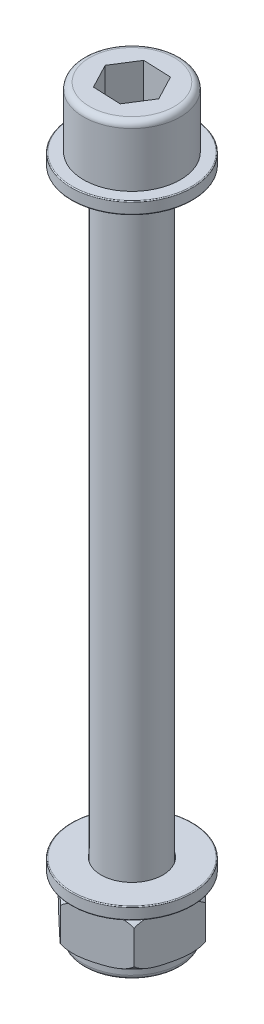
ISO-10303-21;
HEADER;
FILE_DESCRIPTION(('STEP AP214'),'2;1');
FILE_NAME('part.step','',(''),(''),'','','');
FILE_SCHEMA(('AUTOMOTIVE_DESIGN { 1 0 10303 214 1 1 1 1 }'));
ENDSEC;
DATA;
#1=APPLICATION_CONTEXT('core data for automotive mechanical design processes');
#2=APPLICATION_PROTOCOL_DEFINITION('international standard','automotive_design',2000,#1);
#3=PRODUCT_CONTEXT('',#1,'mechanical');
#4=PRODUCT('Part','Part','',(#3));
#5=PRODUCT_RELATED_PRODUCT_CATEGORY('part','',(#4));
#6=PRODUCT_DEFINITION_FORMATION('','',#4);
#7=PRODUCT_DEFINITION_CONTEXT('part definition',#1,'design');
#8=PRODUCT_DEFINITION('design','',#6,#7);
#9=PRODUCT_DEFINITION_SHAPE('','',#8);
#10=(LENGTH_UNIT() NAMED_UNIT(*) SI_UNIT(.MILLI.,.METRE.));
#11=(NAMED_UNIT(*) PLANE_ANGLE_UNIT() SI_UNIT($,.RADIAN.));
#12=(NAMED_UNIT(*) SI_UNIT($,.STERADIAN.) SOLID_ANGLE_UNIT());
#13=UNCERTAINTY_MEASURE_WITH_UNIT(LENGTH_MEASURE(1.E-05),#10,'distance_accuracy_value','');
#14=(GEOMETRIC_REPRESENTATION_CONTEXT(3) GLOBAL_UNCERTAINTY_ASSIGNED_CONTEXT((#13)) GLOBAL_UNIT_ASSIGNED_CONTEXT((#10,
#11,#12)) REPRESENTATION_CONTEXT('',''));
#15=CARTESIAN_POINT('',(0.,0.,0.));
#16=DIRECTION('',(0.,0.,1.));
#17=DIRECTION('',(1.,0.,0.));
#18=AXIS2_PLACEMENT_3D('',#15,#16,#17);
#19=CARTESIAN_POINT('',(0.,101.,0.));
#20=DIRECTION('',(0.,1.,0.));
#21=DIRECTION('',(0.,0.,1.));
#22=AXIS2_PLACEMENT_3D('',#19,#20,#21);
#23=CYLINDRICAL_SURFACE('',#22,5.10000000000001);
#24=CARTESIAN_POINT('',(0.,-2.,0.));
#25=DIRECTION('',(0.,1.,0.));
#26=DIRECTION('',(0.,0.,1.));
#27=AXIS2_PLACEMENT_3D('',#24,#25,#26);
#28=CIRCLE('',#27,5.10000000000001);
#29=CARTESIAN_POINT('',(0.,-2.,5.10000000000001));
#30=VERTEX_POINT('',#29);
#31=EDGE_CURVE('E11',#30,#30,#28,.T.);
#32=ORIENTED_EDGE('',*,*,#31,.F.);
#33=EDGE_LOOP('',(#32));
#34=FACE_BOUND('',#33,.T.);
#35=CARTESIAN_POINT('',(0.,0.,0.));
#36=DIRECTION('',(0.,1.,0.));
#37=DIRECTION('',(0.,0.,1.));
#38=AXIS2_PLACEMENT_3D('',#35,#36,#37);
#39=CIRCLE('',#38,5.10000000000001);
#40=CARTESIAN_POINT('',(0.,0.,5.10000000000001));
#41=VERTEX_POINT('',#40);
#42=EDGE_CURVE('E70',#41,#41,#39,.T.);
#43=ORIENTED_EDGE('',*,*,#42,.T.);
#44=EDGE_LOOP('',(#43));
#45=FACE_BOUND('',#44,.T.);
#46=ADVANCED_FACE('F48',(#34,#45),#23,.F.);
#47=CARTESIAN_POINT('',(5.10000000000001,-2.,0.));
#48=DIRECTION('',(0.,1.,0.));
#49=DIRECTION('',(0.,0.,1.));
#50=AXIS2_PLACEMENT_3D('',#47,#48,#49);
#51=PLANE('',#50);
#52=CARTESIAN_POINT('',(0.,-2.,0.));
#53=DIRECTION('',(0.,1.,0.));
#54=DIRECTION('',(0.,0.,1.));
#55=AXIS2_PLACEMENT_3D('',#52,#53,#54);
#56=CIRCLE('',#55,9.85000000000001);
#57=CARTESIAN_POINT('',(0.,-2.,9.85000000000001));
#58=VERTEX_POINT('',#57);
#59=EDGE_CURVE('E54',#58,#58,#56,.T.);
#60=ORIENTED_EDGE('',*,*,#59,.F.);
#61=EDGE_LOOP('',(#60));
#62=FACE_BOUND('',#61,.T.);
#63=ORIENTED_EDGE('',*,*,#31,.T.);
#64=EDGE_LOOP('',(#63));
#65=FACE_BOUND('',#64,.T.);
#66=ADVANCED_FACE('F95',(#62,#65),#51,.F.);
#67=CARTESIAN_POINT('',(0.,-1.85,0.));
#68=DIRECTION('',(0.,1.,0.));
#69=DIRECTION('',(0.,0.,1.));
#70=AXIS2_PLACEMENT_3D('',#67,#68,#69);
#71=TOROIDAL_SURFACE('',#70,9.85000000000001,0.149999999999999);
#72=CARTESIAN_POINT('',(0.,-1.85,0.));
#73=DIRECTION('',(0.,1.,0.));
#74=DIRECTION('',(0.,0.,1.));
#75=AXIS2_PLACEMENT_3D('',#72,#73,#74);
#76=CIRCLE('',#75,10.);
#77=CARTESIAN_POINT('',(0.,-1.85,10.));
#78=VERTEX_POINT('',#77);
#79=EDGE_CURVE('E58',#78,#78,#76,.T.);
#80=ORIENTED_EDGE('',*,*,#79,.F.);
#81=EDGE_LOOP('',(#80));
#82=FACE_BOUND('',#81,.T.);
#83=ORIENTED_EDGE('',*,*,#59,.T.);
#84=EDGE_LOOP('',(#83));
#85=FACE_BOUND('',#84,.T.);
#86=ADVANCED_FACE('F90',(#82,#85),#71,.T.);
#87=CARTESIAN_POINT('',(0.,101.,0.));
#88=DIRECTION('',(0.,1.,0.));
#89=DIRECTION('',(0.,0.,1.));
#90=AXIS2_PLACEMENT_3D('',#87,#88,#89);
#91=CYLINDRICAL_SURFACE('',#90,10.);
#92=CARTESIAN_POINT('',(0.,-0.149999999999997,0.));
#93=DIRECTION('',(0.,1.,0.));
#94=DIRECTION('',(0.,0.,1.));
#95=AXIS2_PLACEMENT_3D('',#92,#93,#94);
#96=CIRCLE('',#95,10.);
#97=CARTESIAN_POINT('',(0.,-0.149999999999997,10.));
#98=VERTEX_POINT('',#97);
#99=EDGE_CURVE('E62',#98,#98,#96,.T.);
#100=ORIENTED_EDGE('',*,*,#99,.F.);
#101=EDGE_LOOP('',(#100));
#102=FACE_BOUND('',#101,.T.);
#103=ORIENTED_EDGE('',*,*,#79,.T.);
#104=EDGE_LOOP('',(#103));
#105=FACE_BOUND('',#104,.T.);
#106=ADVANCED_FACE('F84',(#102,#105),#91,.T.);
#107=CARTESIAN_POINT('',(0.,-0.149999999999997,0.));
#108=DIRECTION('',(0.,1.,0.));
#109=DIRECTION('',(0.,0.,1.));
#110=AXIS2_PLACEMENT_3D('',#107,#108,#109);
#111=TOROIDAL_SURFACE('',#110,9.85000000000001,0.149999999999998);
#112=CARTESIAN_POINT('',(0.,0.,0.));
#113=DIRECTION('',(0.,1.,0.));
#114=DIRECTION('',(0.,0.,1.));
#115=AXIS2_PLACEMENT_3D('',#112,#113,#114);
#116=CIRCLE('',#115,9.85000000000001);
#117=CARTESIAN_POINT('',(0.,0.,9.85000000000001));
#118=VERTEX_POINT('',#117);
#119=EDGE_CURVE('E67',#118,#118,#116,.T.);
#120=ORIENTED_EDGE('',*,*,#119,.F.);
#121=EDGE_LOOP('',(#120));
#122=FACE_BOUND('',#121,.T.);
#123=ORIENTED_EDGE('',*,*,#99,.T.);
#124=EDGE_LOOP('',(#123));
#125=FACE_BOUND('',#124,.T.);
#126=ADVANCED_FACE('F78',(#122,#125),#111,.T.);
#127=CARTESIAN_POINT('',(5.10000000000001,0.,0.));
#128=DIRECTION('',(0.,-1.,0.));
#129=DIRECTION('',(0.,0.,-1.));
#130=AXIS2_PLACEMENT_3D('',#127,#128,#129);
#131=PLANE('',#130);
#132=ORIENTED_EDGE('',*,*,#42,.F.);
#133=EDGE_LOOP('',(#132));
#134=FACE_BOUND('',#133,.T.);
#135=ORIENTED_EDGE('',*,*,#119,.T.);
#136=EDGE_LOOP('',(#135));
#137=FACE_BOUND('',#136,.T.);
#138=ADVANCED_FACE('F75',(#134,#137),#131,.F.);
#139=CLOSED_SHELL('',(#46,#66,#86,#106,#126,#138));
#140=MANIFOLD_SOLID_BREP('B2',#139);
#141=CARTESIAN_POINT('',(8.00000000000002,-107.,0.));
#142=DIRECTION('',(0.,0.,1.));
#143=DIRECTION('',(0.,1.,0.));
#144=AXIS2_PLACEMENT_3D('',#141,#142,#143);
#145=ELLIPSE('',#144,4.,2.5);
#146=CARTESIAN_POINT('',(0.,0.,0.));
#147=DIRECTION('',(0.,1.,0.));
#148=AXIS1_PLACEMENT('',#146,#147);
#149=SURFACE_OF_REVOLUTION('',#145,#148);
#150=CARTESIAN_POINT('',(0.,-103.,0.));
#151=DIRECTION('',(0.,1.,0.));
#152=DIRECTION('',(0.,0.,1.));
#153=AXIS2_PLACEMENT_3D('',#150,#151,#152);
#154=CIRCLE('',#153,8.00000000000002);
#155=CARTESIAN_POINT('',(0.,-103.,8.00000000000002));
#156=VERTEX_POINT('',#155);
#157=EDGE_CURVE('E348',#156,#156,#154,.T.);
#158=ORIENTED_EDGE('',*,*,#157,.F.);
#159=EDGE_LOOP('',(#158));
#160=FACE_BOUND('',#159,.T.);
#161=CARTESIAN_POINT('',(-9.41077084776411,-104.249144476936,2.78760208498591));
#162=CARTESIAN_POINT('',(-9.39118557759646,-104.178241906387,2.7060233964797));
#163=CARTESIAN_POINT('',(-9.37084369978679,-104.111259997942,2.62129320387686));
#164=CARTESIAN_POINT('',(-9.32891010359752,-103.985215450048,2.44662684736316));
#165=CARTESIAN_POINT('',(-9.30732042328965,-103.926140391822,2.35669917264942));
#166=CARTESIAN_POINT('',(-9.26359796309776,-103.817027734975,2.1745816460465));
#167=CARTESIAN_POINT('',(-9.24148898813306,-103.76681396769,2.08249094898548));
#168=CARTESIAN_POINT('',(-9.19646196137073,-103.673476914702,1.89493950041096));
#169=CARTESIAN_POINT('',(-9.1735435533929,-103.630356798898,1.79947726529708));
#170=CARTESIAN_POINT('',(-9.1253723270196,-103.547831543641,1.59882925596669));
#171=CARTESIAN_POINT('',(-9.10007215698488,-103.508936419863,1.49344624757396));
#172=CARTESIAN_POINT('',(-9.04893887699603,-103.438078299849,1.28046037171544));
#173=CARTESIAN_POINT('',(-9.02310549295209,-103.406118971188,1.17285636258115));
#174=CARTESIAN_POINT('',(-8.97106510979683,-103.348339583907,0.956092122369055));
#175=CARTESIAN_POINT('',(-8.9448580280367,-103.322520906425,0.84693154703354));
#176=CARTESIAN_POINT('',(-8.89179208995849,-103.275849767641,0.625895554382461));
#177=CARTESIAN_POINT('',(-8.86492938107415,-103.255078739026,0.514004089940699));
#178=CARTESIAN_POINT('',(-8.81104335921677,-103.218185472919,0.28955219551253));
#179=CARTESIAN_POINT('',(-8.78402010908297,-103.20206152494,0.176992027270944));
#180=CARTESIAN_POINT('',(-8.72987147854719,-103.173689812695,-0.0485537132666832));
#181=CARTESIAN_POINT('',(-8.70274612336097,-103.16144114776,-0.161539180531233));
#182=CARTESIAN_POINT('',(-8.62873215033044,-103.132390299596,-0.4698301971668));
#183=CARTESIAN_POINT('',(-8.58177699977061,-103.118727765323,-0.665412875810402));
#184=CARTESIAN_POINT('',(-8.48778130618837,-103.098110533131,-1.05693391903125));
#185=CARTESIAN_POINT('',(-8.44074074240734,-103.091157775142,-1.25287237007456));
#186=CARTESIAN_POINT('',(-8.34657331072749,-103.082323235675,-1.64510875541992));
#187=CARTESIAN_POINT('',(-8.2994464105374,-103.080448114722,-1.84140682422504));
#188=CARTESIAN_POINT('',(-8.20510492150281,-103.081301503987,-2.23436821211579));
#189=CARTESIAN_POINT('',(-8.15789033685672,-103.084038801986,-2.4310315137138));
#190=CARTESIAN_POINT('',(-8.06387155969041,-103.094795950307,-2.82264870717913));
#191=CARTESIAN_POINT('',(-8.01706712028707,-103.102773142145,-3.01760362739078));
#192=CARTESIAN_POINT('',(-7.92359608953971,-103.125777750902,-3.40693928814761));
#193=CARTESIAN_POINT('',(-7.87692940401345,-103.140797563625,-3.60132042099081));
#194=CARTESIAN_POINT('',(-7.78394087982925,-103.180685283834,-3.98864629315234));
#195=CARTESIAN_POINT('',(-7.73761845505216,-103.205526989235,-4.18159347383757));
#196=CARTESIAN_POINT('',(-7.64552588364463,-103.268740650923,-4.56518742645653));
#197=CARTESIAN_POINT('',(-7.59975493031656,-103.307089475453,-4.75583755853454));
#198=CARTESIAN_POINT('',(-7.53526134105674,-103.374378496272,-5.02447324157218));
#199=CARTESIAN_POINT('',(-7.51612191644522,-103.396045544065,-5.1041948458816));
#200=CARTESIAN_POINT('',(-7.47807022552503,-103.442930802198,-5.26269187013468));
#201=CARTESIAN_POINT('',(-7.45915806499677,-103.468150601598,-5.34146684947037));
#202=CARTESIAN_POINT('',(-7.4216307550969,-103.522456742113,-5.49777966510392));
#203=CARTESIAN_POINT('',(-7.40301570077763,-103.551544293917,-5.57531710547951));
#204=CARTESIAN_POINT('',(-7.36627892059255,-103.613677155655,-5.72833712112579));
#205=CARTESIAN_POINT('',(-7.34815487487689,-103.64669718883,-5.80382935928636));
#206=CARTESIAN_POINT('',(-7.31237378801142,-103.71706578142,-5.95286861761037));
#207=CARTESIAN_POINT('',(-7.2947166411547,-103.754413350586,-6.02641607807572));
#208=CARTESIAN_POINT('',(-7.25997306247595,-103.833590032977,-6.1711337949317));
#209=CARTESIAN_POINT('',(-7.24288624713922,-103.875416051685,-6.24230564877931));
#210=CARTESIAN_POINT('',(-7.20748937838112,-103.968640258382,-6.38974452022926));
#211=CARTESIAN_POINT('',(-7.18925743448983,-104.02058592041,-6.46568618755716));
#212=CARTESIAN_POINT('',(-7.1536681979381,-104.130429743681,-6.61392633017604));
#213=CARTESIAN_POINT('',(-7.13631545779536,-104.188354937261,-6.68620584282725));
#214=CARTESIAN_POINT('',(-7.1195196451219,-104.249144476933,-6.75616558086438));
#215=B_SPLINE_CURVE_WITH_KNOTS('',3,(#161,#162,#163,#164,#165,#166,#167,#168,#169,#170,#171,
#172,#173,#174,#175,#176,#177,#178,#179,#180,#181,#182,#183,#184,#185,#186,#187,#188,#189,#190,
#191,#192,#193,#194,#195,#196,#197,#198,#199,#200,#201,#202,#203,#204,#205,#206,#207,#208,#209,
#210,#211,#212,#213,#214),.UNSPECIFIED.,.F.,.F.,(4,2,2,2,2,2,2,2,2,2,2,2,2,2,2,2,2,2,2,2,2,2,2,
2,2,2,4),(0.,0.329337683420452,0.658151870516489,0.979426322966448,1.30084395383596,
1.64601405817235,1.99136624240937,2.33679602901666,2.6874752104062,3.03802514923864,
3.38849355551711,3.99312439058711,4.59792998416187,5.20352854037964,5.81028221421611,
6.41215646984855,7.01338234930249,7.61301503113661,8.21162575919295,8.46596579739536,
8.72041995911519,8.97495395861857,9.22793222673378,9.48085272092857,9.73359956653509,
10.0147291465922,10.2971904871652),.UNSPECIFIED.);
#216=CARTESIAN_POINT('',(-9.41077084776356,-104.249144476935,2.78760208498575));
#217=VERTEX_POINT('',#216);
#218=CARTESIAN_POINT('',(-7.1195196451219,-104.249144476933,-6.75616558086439));
#219=VERTEX_POINT('',#218);
#220=EDGE_CURVE('E156',#217,#219,#215,.T.);
#221=ORIENTED_EDGE('',*,*,#220,.F.);
#222=CARTESIAN_POINT('',(-2.29125120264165,-104.249144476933,9.54376766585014));
#223=CARTESIAN_POINT('',(-2.35210778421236,-104.178241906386,9.48601698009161));
#224=CARTESIAN_POINT('',(-2.41531534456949,-104.111259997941,9.42603530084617));
#225=CARTESIAN_POINT('',(-2.54561404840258,-103.985215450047,9.30238656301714));
#226=CARTESIAN_POINT('',(-2.61269885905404,-103.926140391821,9.238725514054));
#227=CARTESIAN_POINT('',(-2.74855603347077,-103.817027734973,9.10980198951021));
#228=CARTESIAN_POINT('',(-2.81725442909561,-103.766813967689,9.04460970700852));
#229=CARTESIAN_POINT('',(-2.9571652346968,-103.673476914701,8.91183943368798));
#230=CARTESIAN_POINT('',(-3.02837875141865,-103.630356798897,8.84426039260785));
#231=CARTESIAN_POINT('',(-3.17805941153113,-103.54783154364,8.70221888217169));
#232=CARTESIAN_POINT('',(-3.25667368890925,-103.508936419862,8.62761678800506));
#233=CARTESIAN_POINT('',(-3.41555822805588,-103.438078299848,8.47684113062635));
#234=CARTESIAN_POINT('',(-3.4958293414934,-103.406118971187,8.40066675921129));
#235=CARTESIAN_POINT('',(-3.65753248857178,-103.348339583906,8.24721634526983));
#236=CARTESIAN_POINT('',(-3.73896477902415,-103.322520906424,8.1699400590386));
#237=CARTESIAN_POINT('',(-3.90385459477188,-103.27584976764,8.0134656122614));
#238=CARTESIAN_POINT('',(-3.98732409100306,-103.255078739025,7.93425609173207));
#239=CARTESIAN_POINT('',(-4.154762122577,-103.218185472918,7.77536348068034));
#240=CARTESIAN_POINT('',(-4.23873046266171,-103.202061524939,7.69568057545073));
#241=CARTESIAN_POINT('',(-4.40698448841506,-103.173689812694,7.53601361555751));
#242=CARTESIAN_POINT('',(-4.49127009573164,-103.16144114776,7.45602963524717));
#243=CARTESIAN_POINT('',(-4.72125096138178,-103.132390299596,7.23778614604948));
#244=CARTESIAN_POINT('',(-4.86715295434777,-103.118727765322,7.09933045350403));
#245=CARTESIAN_POINT('',(-5.15922227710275,-103.09811053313,6.82216727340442));
#246=CARTESIAN_POINT('',(-5.30538967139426,-103.091157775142,6.68345972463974));
#247=CARTESIAN_POINT('',(-5.59799262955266,-103.082323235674,6.40579014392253));
#248=CARTESIAN_POINT('',(-5.744428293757,-103.080448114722,6.26682801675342));
#249=CARTESIAN_POINT('',(-6.03757209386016,-103.081301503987,5.98864519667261));
#250=CARTESIAN_POINT('',(-6.18428021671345,-103.084038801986,5.84942451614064));
#251=CARTESIAN_POINT('',(-6.47642126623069,-103.094795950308,5.57219326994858));
#252=CARTESIAN_POINT('',(-6.62185496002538,-103.102773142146,5.43418197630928));
#253=CARTESIAN_POINT('',(-6.91229401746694,-103.125777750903,5.15856585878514));
#254=CARTESIAN_POINT('',(-7.05729967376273,-103.140797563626,5.0209607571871));
#255=CARTESIAN_POINT('',(-7.34623945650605,-103.180685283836,4.74676739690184));
#256=CARTESIAN_POINT('',(-7.49017540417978,-103.205526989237,4.61017740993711));
#257=CARTESIAN_POINT('',(-7.77633122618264,-103.268740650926,4.33862592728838));
#258=CARTESIAN_POINT('',(-7.91855360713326,-103.307089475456,4.20366205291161));
#259=CARTESIAN_POINT('',(-8.11895213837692,-103.374378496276,4.01349112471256));
#260=CARTESIAN_POINT('',(-8.17842336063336,-103.39604554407,3.95705509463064));
#261=CARTESIAN_POINT('',(-8.29665996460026,-103.442930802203,3.84485285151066));
#262=CARTESIAN_POINT('',(-8.35542501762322,-103.468150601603,3.78908695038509));
#263=CARTESIAN_POINT('',(-8.47203223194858,-103.522456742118,3.67843093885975));
#264=CARTESIAN_POINT('',(-8.52987409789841,-103.551544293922,3.62354110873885));
#265=CARTESIAN_POINT('',(-8.64402492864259,-103.61367715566,3.51521611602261));
#266=CARTESIAN_POINT('',(-8.70034110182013,-103.646697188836,3.46177411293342));
#267=CARTESIAN_POINT('',(-8.81152234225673,-103.717065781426,3.35626715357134));
#268=CARTESIAN_POINT('',(-8.86638773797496,-103.754413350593,3.30420188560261));
#269=CARTESIAN_POINT('',(-8.97434516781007,-103.833590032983,3.2017542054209));
#270=CARTESIAN_POINT('',(-9.02743839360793,-103.875416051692,3.15137066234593));
#271=CARTESIAN_POINT('',(-9.13742576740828,-103.968640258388,3.04699663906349));
#272=CARTESIAN_POINT('',(-9.19407720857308,-104.020585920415,2.99323647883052));
#273=CARTESIAN_POINT('',(-9.30466231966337,-104.130429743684,2.8882952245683));
#274=CARTESIAN_POINT('',(-9.35858184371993,-104.188354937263,2.83712755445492));
#275=CARTESIAN_POINT('',(-9.41077084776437,-104.249144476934,2.78760208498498));
#276=B_SPLINE_CURVE_WITH_KNOTS('',3,(#222,#223,#224,#225,#226,#227,#228,#229,#230,#231,#232,
#233,#234,#235,#236,#237,#238,#239,#240,#241,#242,#243,#244,#245,#246,#247,#248,#249,#250,#251,
#252,#253,#254,#255,#256,#257,#258,#259,#260,#261,#262,#263,#264,#265,#266,#267,#268,#269,#270,
#271,#272,#273,#274,#275),.UNSPECIFIED.,.F.,.F.,(4,2,2,2,2,2,2,2,2,2,2,2,2,2,2,2,2,2,2,2,2,2,2,
2,2,2,4),(0.,0.329337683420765,0.658151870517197,0.97942632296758,1.30084395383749,
1.64601405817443,1.99136624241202,2.33679602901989,2.68747521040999,3.03802514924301,
3.38849355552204,3.99312439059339,4.59792998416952,5.20352854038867,5.81028221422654,
6.41215646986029,7.01338234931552,7.61301503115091,8.21162575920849,8.46596579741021,
8.72041995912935,8.97495395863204,9.22793222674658,9.48085272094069,9.73359956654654,
10.0147291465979,10.297190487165),.UNSPECIFIED.);
#277=CARTESIAN_POINT('',(-2.29125120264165,-104.249144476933,9.54376766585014));
#278=VERTEX_POINT('',#277);
#279=EDGE_CURVE('E255',#278,#217,#276,.T.);
#280=ORIENTED_EDGE('',*,*,#279,.F.);
#281=CARTESIAN_POINT('',(7.11951964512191,-104.249144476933,6.75616558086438));
#282=CARTESIAN_POINT('',(7.03907779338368,-104.178241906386,6.77999358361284));
#283=CARTESIAN_POINT('',(6.95552835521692,-104.111259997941,6.80474209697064));
#284=CARTESIAN_POINT('',(6.78329605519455,-103.985215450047,6.85575971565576));
#285=CARTESIAN_POINT('',(6.69462156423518,-103.926140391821,6.88202634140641));
#286=CARTESIAN_POINT('',(6.51504192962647,-103.817027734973,6.93522034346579));
#287=CARTESIAN_POINT('',(6.4242345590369,-103.766813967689,6.96211875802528));
#288=CARTESIAN_POINT('',(6.23929672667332,-103.673476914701,7.01689993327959));
#289=CARTESIAN_POINT('',(6.1451648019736,-103.630356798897,7.04478312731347));
#290=CARTESIAN_POINT('',(5.94731291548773,-103.54783154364,7.10338962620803));
#291=CARTESIAN_POINT('',(5.84339846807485,-103.508936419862,7.13417054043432));
#292=CARTESIAN_POINT('',(5.63338064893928,-103.438078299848,7.19638075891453));
#293=CARTESIAN_POINT('',(5.52727615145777,-103.406118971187,7.22781039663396));
#294=CARTESIAN_POINT('',(5.31353262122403,-103.348339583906,7.29112422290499));
#295=CARTESIAN_POINT('',(5.20589324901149,-103.322520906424,7.32300851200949));
#296=CARTESIAN_POINT('',(4.98793749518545,-103.27584976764,7.38757005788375));
#297=CARTESIAN_POINT('',(4.87760529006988,-103.255078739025,7.42025200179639));
#298=CARTESIAN_POINT('',(4.65628123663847,-103.218185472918,7.48581128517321));
#299=CARTESIAN_POINT('',(4.54528964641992,-103.202061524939,7.51868854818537));
#300=CARTESIAN_POINT('',(4.32288699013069,-103.173689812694,7.58456732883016));
#301=CARTESIAN_POINT('',(4.21147602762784,-103.16144114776,7.61756881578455));
#302=CARTESIAN_POINT('',(3.90748118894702,-103.132390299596,7.70761634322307));
#303=CARTESIAN_POINT('',(3.7146240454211,-103.118727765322,7.76474332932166));
#304=CARTESIAN_POINT('',(3.32855902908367,-103.09811053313,7.87910119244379));
#305=CARTESIAN_POINT('',(3.13535107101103,-103.091157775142,7.93633209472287));
#306=CARTESIAN_POINT('',(2.74858068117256,-103.082323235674,8.05089889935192));
#307=CARTESIAN_POINT('',(2.55501811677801,-103.080448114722,8.10823484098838));
#308=CARTESIAN_POINT('',(2.16753282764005,-103.081301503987,8.22301340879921));
#309=CARTESIAN_POINT('',(1.97361012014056,-103.084038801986,8.2804560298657));
#310=CARTESIAN_POINT('',(1.5874502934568,-103.094795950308,8.39484197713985));
#311=CARTESIAN_POINT('',(1.39521216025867,-103.102773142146,8.45178560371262));
#312=CARTESIAN_POINT('',(1.01130207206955,-103.125777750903,8.56550514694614));
#313=CARTESIAN_POINT('',(0.819629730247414,-103.140797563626,8.62228117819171));
#314=CARTESIAN_POINT('',(0.437701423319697,-103.180685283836,8.73541369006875));
#315=CARTESIAN_POINT('',(0.247443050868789,-103.205526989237,8.79177088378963));
#316=CARTESIAN_POINT('',(-0.130805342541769,-103.268740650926,8.90381335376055));
#317=CARTESIAN_POINT('',(-0.318798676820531,-103.307089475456,8.95949961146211));
#318=CARTESIAN_POINT('',(-0.583690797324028,-103.374378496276,9.03796436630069));
#319=CARTESIAN_POINT('',(-0.662301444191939,-103.39604554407,9.06124994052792));
#320=CARTESIAN_POINT('',(-0.818589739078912,-103.442930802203,9.10754472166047));
#321=CARTESIAN_POINT('',(-0.896266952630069,-103.468150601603,9.13055379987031));
#322=CARTESIAN_POINT('',(-1.05040147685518,-103.522456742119,9.17621060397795));
#323=CARTESIAN_POINT('',(-1.12685839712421,-103.551544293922,9.19885821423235));
#324=CARTESIAN_POINT('',(-1.27774600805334,-103.613677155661,9.24355323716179));
#325=CARTESIAN_POINT('',(-1.35218622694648,-103.646697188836,9.26560347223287));
#326=CARTESIAN_POINT('',(-1.4991485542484,-103.717065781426,9.30913577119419));
#327=CARTESIAN_POINT('',(-1.57167109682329,-103.754413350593,9.3306179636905));
#328=CARTESIAN_POINT('',(-1.71437210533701,-103.833590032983,9.37288800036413));
#329=CARTESIAN_POINT('',(-1.78455214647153,-103.875416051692,9.39367631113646));
#330=CARTESIAN_POINT('',(-1.92993638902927,-103.968640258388,9.43674115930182));
#331=CARTESIAN_POINT('',(-2.00481977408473,-104.020585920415,9.45892266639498));
#332=CARTESIAN_POINT('',(-2.15099412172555,-104.130429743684,9.50222155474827));
#333=CARTESIAN_POINT('',(-2.2222663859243,-104.188354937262,9.52333339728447));
#334=CARTESIAN_POINT('',(-2.29125120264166,-104.249144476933,9.54376766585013));
#335=B_SPLINE_CURVE_WITH_KNOTS('',3,(#281,#282,#283,#284,#285,#286,#287,#288,#289,#290,#291,
#292,#293,#294,#295,#296,#297,#298,#299,#300,#301,#302,#303,#304,#305,#306,#307,#308,#309,#310,
#311,#312,#313,#314,#315,#316,#317,#318,#319,#320,#321,#322,#323,#324,#325,#326,#327,#328,#329,
#330,#331,#332,#333,#334),.UNSPECIFIED.,.F.,.F.,(4,2,2,2,2,2,2,2,2,2,2,2,2,2,2,2,2,2,2,2,2,2,2,
2,2,2,4),(0.,0.329337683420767,0.658151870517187,0.979426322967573,1.30084395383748,
1.64601405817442,1.99136624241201,2.33679602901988,2.68747521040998,3.038025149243,
3.38849355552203,3.99312439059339,4.59792998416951,5.20352854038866,5.81028221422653,
6.41215646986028,7.01338234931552,7.61301503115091,8.21162575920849,8.46596579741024,
8.72041995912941,8.97495395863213,9.22793222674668,9.48085272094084,9.73359956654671,
10.0147291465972,10.2971904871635),.UNSPECIFIED.);
#336=CARTESIAN_POINT('',(7.1195196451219,-104.249144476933,6.75616558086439));
#337=VERTEX_POINT('',#336);
#338=EDGE_CURVE('E211',#337,#278,#335,.T.);
#339=ORIENTED_EDGE('',*,*,#338,.F.);
#340=CARTESIAN_POINT('',(9.41077084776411,-104.249144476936,-2.78760208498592));
#341=CARTESIAN_POINT('',(9.39118557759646,-104.178241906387,-2.70602339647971));
#342=CARTESIAN_POINT('',(9.37084369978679,-104.111259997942,-2.62129320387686));
#343=CARTESIAN_POINT('',(9.32891010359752,-103.985215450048,-2.44662684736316));
#344=CARTESIAN_POINT('',(9.30732042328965,-103.926140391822,-2.35669917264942));
#345=CARTESIAN_POINT('',(9.26359796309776,-103.817027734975,-2.1745816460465));
#346=CARTESIAN_POINT('',(9.24148898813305,-103.76681396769,-2.08249094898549));
#347=CARTESIAN_POINT('',(9.19646196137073,-103.673476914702,-1.89493950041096));
#348=CARTESIAN_POINT('',(9.1735435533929,-103.630356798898,-1.79947726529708));
#349=CARTESIAN_POINT('',(9.1253723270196,-103.547831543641,-1.59882925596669));
#350=CARTESIAN_POINT('',(9.10007215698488,-103.508936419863,-1.49344624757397));
#351=CARTESIAN_POINT('',(9.04893887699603,-103.438078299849,-1.28046037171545));
#352=CARTESIAN_POINT('',(9.02310549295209,-103.406118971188,-1.17285636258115));
#353=CARTESIAN_POINT('',(8.97106510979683,-103.348339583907,-0.956092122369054));
#354=CARTESIAN_POINT('',(8.9448580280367,-103.322520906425,-0.84693154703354));
#355=CARTESIAN_POINT('',(8.89179208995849,-103.275849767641,-0.625895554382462));
#356=CARTESIAN_POINT('',(8.86492938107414,-103.255078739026,-0.514004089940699));
#357=CARTESIAN_POINT('',(8.81104335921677,-103.218185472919,-0.289552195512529));
#358=CARTESIAN_POINT('',(8.78402010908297,-103.20206152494,-0.176992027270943));
#359=CARTESIAN_POINT('',(8.72987147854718,-103.173689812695,0.0485537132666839));
#360=CARTESIAN_POINT('',(8.70274612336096,-103.16144114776,0.161539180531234));
#361=CARTESIAN_POINT('',(8.62873215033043,-103.132390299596,0.469830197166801));
#362=CARTESIAN_POINT('',(8.58177699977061,-103.118727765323,0.665412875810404));
#363=CARTESIAN_POINT('',(8.48778130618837,-103.098110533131,1.05693391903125));
#364=CARTESIAN_POINT('',(8.44074074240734,-103.091157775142,1.25287237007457));
#365=CARTESIAN_POINT('',(8.34657331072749,-103.082323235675,1.64510875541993));
#366=CARTESIAN_POINT('',(8.29944641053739,-103.080448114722,1.84140682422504));
#367=CARTESIAN_POINT('',(8.20510492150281,-103.081301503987,2.23436821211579));
#368=CARTESIAN_POINT('',(8.15789033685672,-103.084038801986,2.43103151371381));
#369=CARTESIAN_POINT('',(8.06387155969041,-103.094795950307,2.82264870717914));
#370=CARTESIAN_POINT('',(8.01706712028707,-103.102773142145,3.01760362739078));
#371=CARTESIAN_POINT('',(7.9235960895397,-103.125777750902,3.40693928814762));
#372=CARTESIAN_POINT('',(7.87692940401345,-103.140797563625,3.60132042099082));
#373=CARTESIAN_POINT('',(7.78394087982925,-103.180685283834,3.98864629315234));
#374=CARTESIAN_POINT('',(7.73761845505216,-103.205526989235,4.18159347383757));
#375=CARTESIAN_POINT('',(7.64552588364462,-103.268740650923,4.56518742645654));
#376=CARTESIAN_POINT('',(7.59975493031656,-103.307089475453,4.75583755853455));
#377=CARTESIAN_POINT('',(7.53526134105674,-103.374378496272,5.02447324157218));
#378=CARTESIAN_POINT('',(7.51612191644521,-103.396045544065,5.1041948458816));
#379=CARTESIAN_POINT('',(7.47807022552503,-103.442930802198,5.26269187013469));
#380=CARTESIAN_POINT('',(7.45915806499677,-103.468150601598,5.34146684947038));
#381=CARTESIAN_POINT('',(7.4216307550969,-103.522456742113,5.49777966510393));
#382=CARTESIAN_POINT('',(7.40301570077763,-103.551544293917,5.57531710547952));
#383=CARTESIAN_POINT('',(7.36627892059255,-103.613677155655,5.72833712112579));
#384=CARTESIAN_POINT('',(7.34815487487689,-103.64669718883,5.80382935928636));
#385=CARTESIAN_POINT('',(7.31237378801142,-103.71706578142,5.95286861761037));
#386=CARTESIAN_POINT('',(7.29471664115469,-103.754413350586,6.02641607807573));
#387=CARTESIAN_POINT('',(7.25997306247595,-103.833590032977,6.17113379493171));
#388=CARTESIAN_POINT('',(7.24288624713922,-103.875416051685,6.24230564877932));
#389=CARTESIAN_POINT('',(7.20748937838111,-103.968640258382,6.38974452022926));
#390=CARTESIAN_POINT('',(7.18925743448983,-104.02058592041,6.46568618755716));
#391=CARTESIAN_POINT('',(7.15366819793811,-104.130429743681,6.61392633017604));
#392=CARTESIAN_POINT('',(7.13631545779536,-104.188354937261,6.68620584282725));
#393=CARTESIAN_POINT('',(7.11951964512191,-104.249144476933,6.75616558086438));
#394=B_SPLINE_CURVE_WITH_KNOTS('',3,(#340,#341,#342,#343,#344,#345,#346,#347,#348,#349,#350,
#351,#352,#353,#354,#355,#356,#357,#358,#359,#360,#361,#362,#363,#364,#365,#366,#367,#368,#369,
#370,#371,#372,#373,#374,#375,#376,#377,#378,#379,#380,#381,#382,#383,#384,#385,#386,#387,#388,
#389,#390,#391,#392,#393),.UNSPECIFIED.,.F.,.F.,(4,2,2,2,2,2,2,2,2,2,2,2,2,2,2,2,2,2,2,2,2,2,2,
2,2,2,4),(0.,0.329337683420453,0.65815187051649,0.979426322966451,1.30084395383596,
1.64601405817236,1.99136624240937,2.33679602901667,2.6874752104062,3.03802514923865,
3.38849355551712,3.99312439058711,4.59792998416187,5.20352854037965,5.81028221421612,
6.41215646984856,7.01338234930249,7.61301503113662,8.21162575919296,8.46596579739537,
8.7204199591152,8.97495395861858,9.22793222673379,9.48085272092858,9.7335995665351,
10.0147291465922,10.2971904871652),.UNSPECIFIED.);
#395=CARTESIAN_POINT('',(9.41077084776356,-104.249144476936,-2.78760208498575));
#396=VERTEX_POINT('',#395);
#397=EDGE_CURVE('E254',#396,#337,#394,.T.);
#398=ORIENTED_EDGE('',*,*,#397,.F.);
#399=CARTESIAN_POINT('',(2.29125120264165,-104.249144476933,-9.54376766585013));
#400=CARTESIAN_POINT('',(2.35210778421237,-104.178241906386,-9.4860169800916));
#401=CARTESIAN_POINT('',(2.4153153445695,-104.111259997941,-9.42603530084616));
#402=CARTESIAN_POINT('',(2.54561404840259,-103.985215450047,-9.30238656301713));
#403=CARTESIAN_POINT('',(2.61269885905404,-103.926140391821,-9.23872551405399));
#404=CARTESIAN_POINT('',(2.74855603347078,-103.817027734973,-9.10980198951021));
#405=CARTESIAN_POINT('',(2.81725442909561,-103.766813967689,-9.04460970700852));
#406=CARTESIAN_POINT('',(2.9571652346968,-103.673476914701,-8.91183943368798));
#407=CARTESIAN_POINT('',(3.02837875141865,-103.630356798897,-8.84426039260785));
#408=CARTESIAN_POINT('',(3.17805941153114,-103.54783154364,-8.70221888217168));
#409=CARTESIAN_POINT('',(3.25667368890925,-103.508936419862,-8.62761678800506));
#410=CARTESIAN_POINT('',(3.41555822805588,-103.438078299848,-8.47684113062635));
#411=CARTESIAN_POINT('',(3.4958293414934,-103.406118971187,-8.40066675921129));
#412=CARTESIAN_POINT('',(3.65753248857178,-103.348339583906,-8.24721634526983));
#413=CARTESIAN_POINT('',(3.73896477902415,-103.322520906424,-8.1699400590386));
#414=CARTESIAN_POINT('',(3.90385459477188,-103.27584976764,-8.0134656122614));
#415=CARTESIAN_POINT('',(3.98732409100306,-103.255078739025,-7.93425609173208));
#416=CARTESIAN_POINT('',(4.154762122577,-103.218185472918,-7.77536348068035));
#417=CARTESIAN_POINT('',(4.23873046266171,-103.202061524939,-7.69568057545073));
#418=CARTESIAN_POINT('',(4.40698448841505,-103.173689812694,-7.53601361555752));
#419=CARTESIAN_POINT('',(4.49127009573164,-103.16144114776,-7.45602963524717));
#420=CARTESIAN_POINT('',(4.72125096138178,-103.132390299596,-7.23778614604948));
#421=CARTESIAN_POINT('',(4.86715295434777,-103.118727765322,-7.09933045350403));
#422=CARTESIAN_POINT('',(5.15922227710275,-103.09811053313,-6.82216727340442));
#423=CARTESIAN_POINT('',(5.30538967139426,-103.091157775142,-6.68345972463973));
#424=CARTESIAN_POINT('',(5.59799262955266,-103.082323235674,-6.40579014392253));
#425=CARTESIAN_POINT('',(5.744428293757,-103.080448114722,-6.26682801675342));
#426=CARTESIAN_POINT('',(6.03757209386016,-103.081301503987,-5.98864519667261));
#427=CARTESIAN_POINT('',(6.18428021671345,-103.084038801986,-5.84942451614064));
#428=CARTESIAN_POINT('',(6.47642126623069,-103.094795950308,-5.57219326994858));
#429=CARTESIAN_POINT('',(6.62185496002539,-103.102773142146,-5.43418197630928));
#430=CARTESIAN_POINT('',(6.91229401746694,-103.125777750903,-5.15856585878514));
#431=CARTESIAN_POINT('',(7.05729967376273,-103.140797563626,-5.0209607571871));
#432=CARTESIAN_POINT('',(7.34623945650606,-103.180685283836,-4.74676739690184));
#433=CARTESIAN_POINT('',(7.49017540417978,-103.205526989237,-4.61017740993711));
#434=CARTESIAN_POINT('',(7.77633122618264,-103.268740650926,-4.33862592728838));
#435=CARTESIAN_POINT('',(7.91855360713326,-103.307089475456,-4.20366205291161));
#436=CARTESIAN_POINT('',(8.11895213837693,-103.374378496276,-4.01349112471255));
#437=CARTESIAN_POINT('',(8.17842336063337,-103.39604554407,-3.95705509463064));
#438=CARTESIAN_POINT('',(8.29665996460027,-103.442930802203,-3.84485285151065));
#439=CARTESIAN_POINT('',(8.35542501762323,-103.468150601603,-3.78908695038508));
#440=CARTESIAN_POINT('',(8.47203223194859,-103.522456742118,-3.67843093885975));
#441=CARTESIAN_POINT('',(8.52987409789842,-103.551544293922,-3.62354110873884));
#442=CARTESIAN_POINT('',(8.6440249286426,-103.61367715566,-3.51521611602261));
#443=CARTESIAN_POINT('',(8.70034110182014,-103.646697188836,-3.46177411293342));
#444=CARTESIAN_POINT('',(8.81152234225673,-103.717065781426,-3.35626715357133));
#445=CARTESIAN_POINT('',(8.86638773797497,-103.754413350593,-3.3042018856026));
#446=CARTESIAN_POINT('',(8.97434516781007,-103.833590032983,-3.20175420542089));
#447=CARTESIAN_POINT('',(9.02743839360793,-103.875416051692,-3.15137066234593));
#448=CARTESIAN_POINT('',(9.13742576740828,-103.968640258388,-3.04699663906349));
#449=CARTESIAN_POINT('',(9.19407720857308,-104.020585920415,-2.99323647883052));
#450=CARTESIAN_POINT('',(9.30466231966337,-104.130429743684,-2.8882952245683));
#451=CARTESIAN_POINT('',(9.35858184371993,-104.188354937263,-2.83712755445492));
#452=CARTESIAN_POINT('',(9.41077084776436,-104.249144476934,-2.78760208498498));
#453=B_SPLINE_CURVE_WITH_KNOTS('',3,(#399,#400,#401,#402,#403,#404,#405,#406,#407,#408,#409,
#410,#411,#412,#413,#414,#415,#416,#417,#418,#419,#420,#421,#422,#423,#424,#425,#426,#427,#428,
#429,#430,#431,#432,#433,#434,#435,#436,#437,#438,#439,#440,#441,#442,#443,#444,#445,#446,#447,
#448,#449,#450,#451,#452),.UNSPECIFIED.,.F.,.F.,(4,2,2,2,2,2,2,2,2,2,2,2,2,2,2,2,2,2,2,2,2,2,2,
2,2,2,4),(0.,0.329337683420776,0.658151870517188,0.979426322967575,1.30084395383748,
1.64601405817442,1.99136624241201,2.33679602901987,2.68747521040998,3.03802514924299,
3.38849355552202,3.99312439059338,4.59792998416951,5.20352854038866,5.81028221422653,
6.41215646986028,7.01338234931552,7.61301503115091,8.21162575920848,8.46596579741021,
8.72041995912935,8.97495395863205,9.22793222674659,9.4808527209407,9.73359956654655,
10.0147291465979,10.297190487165),.UNSPECIFIED.);
#454=CARTESIAN_POINT('',(2.29125120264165,-104.249144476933,-9.54376766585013));
#455=VERTEX_POINT('',#454);
#456=EDGE_CURVE('E264',#455,#396,#453,.T.);
#457=ORIENTED_EDGE('',*,*,#456,.F.);
#458=CARTESIAN_POINT('',(-7.1195196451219,-104.249144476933,-6.75616558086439));
#459=CARTESIAN_POINT('',(-7.03907779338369,-104.178241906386,-6.77999358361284));
#460=CARTESIAN_POINT('',(-6.95552835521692,-104.111259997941,-6.80474209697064));
#461=CARTESIAN_POINT('',(-6.78329605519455,-103.985215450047,-6.85575971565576));
#462=CARTESIAN_POINT('',(-6.69462156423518,-103.926140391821,-6.88202634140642));
#463=CARTESIAN_POINT('',(-6.51504192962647,-103.817027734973,-6.93522034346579));
#464=CARTESIAN_POINT('',(-6.4242345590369,-103.766813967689,-6.96211875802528));
#465=CARTESIAN_POINT('',(-6.23929672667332,-103.673476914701,-7.01689993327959));
#466=CARTESIAN_POINT('',(-6.1451648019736,-103.630356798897,-7.04478312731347));
#467=CARTESIAN_POINT('',(-5.94731291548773,-103.54783154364,-7.10338962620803));
#468=CARTESIAN_POINT('',(-5.84339846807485,-103.508936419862,-7.13417054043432));
#469=CARTESIAN_POINT('',(-5.63338064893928,-103.438078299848,-7.19638075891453));
#470=CARTESIAN_POINT('',(-5.52727615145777,-103.406118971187,-7.22781039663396));
#471=CARTESIAN_POINT('',(-5.31353262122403,-103.348339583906,-7.29112422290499));
#472=CARTESIAN_POINT('',(-5.20589324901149,-103.322520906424,-7.32300851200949));
#473=CARTESIAN_POINT('',(-4.98793749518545,-103.27584976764,-7.38757005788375));
#474=CARTESIAN_POINT('',(-4.87760529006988,-103.255078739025,-7.42025200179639));
#475=CARTESIAN_POINT('',(-4.65628123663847,-103.218185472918,-7.48581128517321));
#476=CARTESIAN_POINT('',(-4.54528964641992,-103.202061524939,-7.51868854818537));
#477=CARTESIAN_POINT('',(-4.32288699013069,-103.173689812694,-7.58456732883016));
#478=CARTESIAN_POINT('',(-4.21147602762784,-103.16144114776,-7.61756881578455));
#479=CARTESIAN_POINT('',(-3.90748118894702,-103.132390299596,-7.70761634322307));
#480=CARTESIAN_POINT('',(-3.7146240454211,-103.118727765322,-7.76474332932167));
#481=CARTESIAN_POINT('',(-3.32855902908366,-103.09811053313,-7.87910119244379));
#482=CARTESIAN_POINT('',(-3.13535107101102,-103.091157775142,-7.93633209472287));
#483=CARTESIAN_POINT('',(-2.74858068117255,-103.082323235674,-8.05089889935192));
#484=CARTESIAN_POINT('',(-2.555018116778,-103.080448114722,-8.10823484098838));
#485=CARTESIAN_POINT('',(-2.16753282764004,-103.081301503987,-8.22301340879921));
#486=CARTESIAN_POINT('',(-1.97361012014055,-103.084038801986,-8.2804560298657));
#487=CARTESIAN_POINT('',(-1.58745029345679,-103.094795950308,-8.39484197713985));
#488=CARTESIAN_POINT('',(-1.39521216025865,-103.102773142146,-8.45178560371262));
#489=CARTESIAN_POINT('',(-1.01130207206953,-103.125777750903,-8.56550514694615));
#490=CARTESIAN_POINT('',(-0.819629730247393,-103.140797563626,-8.62228117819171));
#491=CARTESIAN_POINT('',(-0.437701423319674,-103.180685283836,-8.73541369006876));
#492=CARTESIAN_POINT('',(-0.247443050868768,-103.205526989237,-8.79177088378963));
#493=CARTESIAN_POINT('',(0.130805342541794,-103.268740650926,-8.90381335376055));
#494=CARTESIAN_POINT('',(0.318798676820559,-103.307089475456,-8.95949961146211));
#495=CARTESIAN_POINT('',(0.583690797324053,-103.374378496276,-9.0379643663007));
#496=CARTESIAN_POINT('',(0.662301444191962,-103.39604554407,-9.06124994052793));
#497=CARTESIAN_POINT('',(0.818589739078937,-103.442930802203,-9.10754472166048));
#498=CARTESIAN_POINT('',(0.896266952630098,-103.468150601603,-9.13055379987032));
#499=CARTESIAN_POINT('',(1.0504014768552,-103.522456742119,-9.17621060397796));
#500=CARTESIAN_POINT('',(1.12685839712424,-103.551544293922,-9.19885821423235));
#501=CARTESIAN_POINT('',(1.27774600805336,-103.613677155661,-9.24355323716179));
#502=CARTESIAN_POINT('',(1.3521862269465,-103.646697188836,-9.26560347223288));
#503=CARTESIAN_POINT('',(1.49914855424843,-103.717065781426,-9.30913577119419));
#504=CARTESIAN_POINT('',(1.57167109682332,-103.754413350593,-9.33061796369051));
#505=CARTESIAN_POINT('',(1.71437210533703,-103.833590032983,-9.37288800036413));
#506=CARTESIAN_POINT('',(1.78455214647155,-103.875416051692,-9.39367631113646));
#507=CARTESIAN_POINT('',(1.92993638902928,-103.968640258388,-9.43674115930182));
#508=CARTESIAN_POINT('',(2.00481977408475,-104.020585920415,-9.45892266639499));
#509=CARTESIAN_POINT('',(2.15099412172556,-104.130429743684,-9.50222155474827));
#510=CARTESIAN_POINT('',(2.2222663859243,-104.188354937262,-9.52333339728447));
#511=CARTESIAN_POINT('',(2.29125120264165,-104.249144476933,-9.54376766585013));
#512=B_SPLINE_CURVE_WITH_KNOTS('',3,(#458,#459,#460,#461,#462,#463,#464,#465,#466,#467,#468,
#469,#470,#471,#472,#473,#474,#475,#476,#477,#478,#479,#480,#481,#482,#483,#484,#485,#486,#487,
#488,#489,#490,#491,#492,#493,#494,#495,#496,#497,#498,#499,#500,#501,#502,#503,#504,#505,#506,
#507,#508,#509,#510,#511),.UNSPECIFIED.,.F.,.F.,(4,2,2,2,2,2,2,2,2,2,2,2,2,2,2,2,2,2,2,2,2,2,2,
2,2,2,4),(0.,0.329337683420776,0.65815187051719,0.979426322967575,1.30084395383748,
1.64601405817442,1.99136624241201,2.33679602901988,2.68747521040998,3.038025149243,
3.38849355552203,3.99312439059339,4.59792998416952,5.20352854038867,5.81028221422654,
6.4121564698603,7.01338234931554,7.61301503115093,8.21162575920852,8.46596579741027,
8.72041995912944,8.97495395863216,9.22793222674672,9.48085272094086,9.73359956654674,
10.0147291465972,10.2971904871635),.UNSPECIFIED.);
#513=EDGE_CURVE('E269',#219,#455,#512,.T.);
#514=ORIENTED_EDGE('',*,*,#513,.F.);
#515=EDGE_LOOP('',(#221,#280,#339,#398,#457,#514));
#516=FACE_BOUND('',#515,.T.);
#517=ADVANCED_FACE('F148',(#160,#516),#149,.T.);
#518=CARTESIAN_POINT('',(0.,-110.979627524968,0.));
#519=DIRECTION('',(0.,1.,0.));
#520=DIRECTION('',(0.,0.,1.));
#521=AXIS2_PLACEMENT_3D('',#518,#519,#520);
#522=CIRCLE('',#521,8.25199575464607);
#523=CARTESIAN_POINT('',(0.,-110.979627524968,8.25199575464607));
#524=VERTEX_POINT('',#523);
#525=EDGE_CURVE('E204',#524,#524,#522,.T.);
#526=ORIENTED_EDGE('',*,*,#525,.T.);
#527=EDGE_LOOP('',(#526));
#528=FACE_BOUND('',#527,.T.);
#529=CARTESIAN_POINT('',(-7.1195196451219,-109.750855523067,-6.75616558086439));
#530=CARTESIAN_POINT('',(-7.13910944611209,-109.821774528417,-6.67456802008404));
#531=CARTESIAN_POINT('',(-7.15945620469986,-109.888771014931,-6.5898174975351));
#532=CARTESIAN_POINT('',(-7.2014000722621,-110.014841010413,-6.41510835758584));
#533=CARTESIAN_POINT('',(-7.22299514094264,-110.073926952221,-6.3251582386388));
#534=CARTESIAN_POINT('',(-7.26672834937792,-110.183056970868,-6.14299594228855));
#535=CARTESIAN_POINT('',(-7.28884266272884,-110.233277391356,-6.05088300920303));
#536=CARTESIAN_POINT('',(-7.33388058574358,-110.326624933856,-5.8632861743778));
#537=CARTESIAN_POINT('',(-7.35680455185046,-110.369748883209,-5.76780078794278));
#538=CARTESIAN_POINT('',(-7.40498511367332,-110.452275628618,-5.56711389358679));
#539=CARTESIAN_POINT('',(-7.43028900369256,-110.4911689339,-5.46171539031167));
#540=CARTESIAN_POINT('',(-7.48142968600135,-110.562022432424,-5.24869868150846));
#541=CARTESIAN_POINT('',(-7.50726675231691,-110.593978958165,-5.14107933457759));
#542=CARTESIAN_POINT('',(-7.55931444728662,-110.65175211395,-4.92428463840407));
#543=CARTESIAN_POINT('',(-7.58552515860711,-110.677567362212,-4.81510894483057));
#544=CARTESIAN_POINT('',(-7.63859860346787,-110.724231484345,-4.59404168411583));
#545=CARTESIAN_POINT('',(-7.66546519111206,-110.74499886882,-4.48213406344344));
#546=CARTESIAN_POINT('',(-7.71935891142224,-110.781884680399,-4.25765010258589));
#547=CARTESIAN_POINT('',(-7.74638598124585,-110.798004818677,-4.14507402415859));
#548=CARTESIAN_POINT('',(-7.80054219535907,-110.826368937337,-3.9194966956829));
#549=CARTESIAN_POINT('',(-7.82767131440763,-110.838613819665,-3.80649555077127));
#550=CARTESIAN_POINT('',(-7.90169869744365,-110.867655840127,-3.49814867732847));
#551=CARTESIAN_POINT('',(-7.94866347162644,-110.881312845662,-3.30252591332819));
#552=CARTESIAN_POINT('',(-8.04267834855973,-110.901918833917,-2.91092496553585));
#553=CARTESIAN_POINT('',(-8.08972847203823,-110.908865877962,-2.71494669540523));
#554=CARTESIAN_POINT('',(-8.1839150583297,-110.917688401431,-2.32263052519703));
#555=CARTESIAN_POINT('',(-8.23105155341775,-110.919557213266,-2.12629249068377));
#556=CARTESIAN_POINT('',(-8.32541236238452,-110.918689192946,-1.733250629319));
#557=CARTESIAN_POINT('',(-8.37263667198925,-110.915943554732,-1.53654682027));
#558=CARTESIAN_POINT('',(-8.46667396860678,-110.905165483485,-1.14485248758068));
#559=CARTESIAN_POINT('',(-8.51348720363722,-110.897175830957,-0.949860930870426));
#560=CARTESIAN_POINT('',(-8.6069755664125,-110.87413908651,-0.560453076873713));
#561=CARTESIAN_POINT('',(-8.65365078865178,-110.859099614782,-0.36603638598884));
#562=CARTESIAN_POINT('',(-8.74665567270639,-110.819161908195,0.0213576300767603));
#563=CARTESIAN_POINT('',(-8.79298592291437,-110.794289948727,0.214337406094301));
#564=CARTESIAN_POINT('',(-8.88509298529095,-110.731001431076,0.597991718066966));
#565=CARTESIAN_POINT('',(-8.93087060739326,-110.692608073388,0.78866962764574));
#566=CARTESIAN_POINT('',(-8.99536439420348,-110.625251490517,1.05730613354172));
#567=CARTESIAN_POINT('',(-9.01449825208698,-110.603569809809,1.13700455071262));
#568=CARTESIAN_POINT('',(-9.05253858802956,-110.556655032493,1.29545427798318));
#569=CARTESIAN_POINT('',(-9.07144496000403,-110.531420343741,1.3742051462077));
#570=CARTESIAN_POINT('',(-9.1089604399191,-110.477084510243,1.53046868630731));
#571=CARTESIAN_POINT('',(-9.12756945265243,-110.44798215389,1.60798096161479));
#572=CARTESIAN_POINT('',(-9.1642940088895,-110.385820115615,1.76095006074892));
#573=CARTESIAN_POINT('',(-9.18241187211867,-110.352785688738,1.83641654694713));
#574=CARTESIAN_POINT('',(-9.21818033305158,-110.282389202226,1.98540321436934));
#575=CARTESIAN_POINT('',(-9.2358310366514,-110.245028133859,2.05892383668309));
#576=CARTESIAN_POINT('',(-9.27056149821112,-110.165825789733,2.20358691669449));
#577=CARTESIAN_POINT('',(-9.28764164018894,-110.123987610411,2.27473097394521));
#578=CARTESIAN_POINT('',(-9.32299019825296,-110.030829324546,2.42196861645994));
#579=CARTESIAN_POINT('',(-9.34118196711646,-109.978972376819,2.49774294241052));
#580=CARTESIAN_POINT('',(-9.37669399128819,-109.869330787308,2.6456614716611));
#581=CARTESIAN_POINT('',(-9.39400972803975,-109.81151932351,2.71778685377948));
#582=CARTESIAN_POINT('',(-9.41077084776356,-109.750855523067,2.78760208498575));
#583=B_SPLINE_CURVE_WITH_KNOTS('',3,(#529,#530,#531,#532,#533,#534,#535,#536,#537,#538,#539,
#540,#541,#542,#543,#544,#545,#546,#547,#548,#549,#550,#551,#552,#553,#554,#555,#556,#557,#558,
#559,#560,#561,#562,#563,#564,#565,#566,#567,#568,#569,#570,#571,#572,#573,#574,#575,#576,#577,
#578,#579,#580,#581,#582),.UNSPECIFIED.,.F.,.F.,(4,2,2,2,2,2,2,2,2,2,2,2,2,2,2,2,2,2,2,2,2,2,2,
2,2,2,4),(0.,0.329413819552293,0.658303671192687,0.979647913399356,1.3011354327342,
1.64634865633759,1.99174395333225,2.33721689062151,2.68794318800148,3.03854017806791,
3.38905550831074,3.99380862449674,4.5987364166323,5.20445808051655,5.81133699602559,
6.4133255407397,7.01466488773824,7.61440801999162,8.21312706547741,8.46740913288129,
8.72180551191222,8.97628177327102,9.22920381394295,9.48206802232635,9.73475846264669,
10.0153123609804,10.297190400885),.UNSPECIFIED.);
#584=CARTESIAN_POINT('',(-7.1195196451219,-109.750855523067,-6.75616558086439));
#585=VERTEX_POINT('',#584);
#586=CARTESIAN_POINT('',(-9.41077084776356,-109.750855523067,2.78760208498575));
#587=VERTEX_POINT('',#586);
#588=EDGE_CURVE('E289',#585,#587,#583,.T.);
#589=ORIENTED_EDGE('',*,*,#588,.F.);
#590=CARTESIAN_POINT('',(2.29125120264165,-109.750855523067,-9.54376766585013));
#591=CARTESIAN_POINT('',(2.21079074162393,-109.821774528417,-9.51993415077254));
#592=CARTESIAN_POINT('',(2.12722125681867,-109.888771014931,-9.49517969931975));
#593=CARTESIAN_POINT('',(1.95494676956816,-110.014841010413,-9.44414958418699));
#594=CARTESIAN_POINT('',(1.86625014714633,-110.073926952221,-9.41787640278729));
#595=CARTESIAN_POINT('',(1.68662636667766,-110.183056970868,-9.36466932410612));
#596=CARTESIAN_POINT('',(1.59579706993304,-110.233277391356,-9.33776441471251));
#597=CARTESIAN_POINT('',(1.41081448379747,-110.326624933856,-9.28296998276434));
#598=CARTESIAN_POINT('',(1.31665973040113,-110.369748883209,-9.25508002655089));
#599=CARTESIAN_POINT('',(1.11876950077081,-110.452275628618,-9.1964621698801));
#600=CARTESIAN_POINT('',(1.01483977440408,-110.4911689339,-9.16567672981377));
#601=CARTESIAN_POINT('',(0.804791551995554,-110.562022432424,-9.10345750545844));
#602=CARTESIAN_POINT('',(0.698671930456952,-110.593978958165,-9.07202338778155));
#603=CARTESIAN_POINT('',(0.484898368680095,-110.65175211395,-9.00870066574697));
#604=CARTESIAN_POINT('',(0.377244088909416,-110.677567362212,-8.97681196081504));
#605=CARTESIAN_POINT('',(0.159257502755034,-110.724231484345,-8.91224128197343));
#606=CARTESIAN_POINT('',(0.0489093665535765,-110.74499886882,-8.87955461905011));
#607=CARTESIAN_POINT('',(-0.172446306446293,-110.781884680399,-8.8139859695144));
#608=CARTESIAN_POINT('',(-0.283453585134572,-110.798004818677,-8.78110405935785));
#609=CARTESIAN_POINT('',(-0.505887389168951,-110.826368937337,-8.71521605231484));
#610=CARTESIAN_POINT('',(-0.617313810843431,-110.838613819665,-8.68220998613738));
#611=CARTESIAN_POINT('',(-0.921363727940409,-110.867655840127,-8.59214614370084));
#612=CARTESIAN_POINT('',(-1.11426039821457,-110.881312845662,-8.53500744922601));
#613=CARTESIAN_POINT('',(-1.50040420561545,-110.901918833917,-8.42062624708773));
#614=CARTESIAN_POINT('',(-1.69365142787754,-110.908865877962,-8.36338371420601));
#615=CARTESIAN_POINT('',(-2.08050049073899,-110.917688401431,-8.24879360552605));
#616=CARTESIAN_POINT('',(-2.2741024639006,-110.919557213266,-8.19144599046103));
#617=CARTESIAN_POINT('',(-2.6616671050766,-110.918689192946,-8.07664391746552));
#618=CARTESIAN_POINT('',(-2.85562975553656,-110.915943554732,-8.0191894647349));
#619=CARTESIAN_POINT('',(-3.24186564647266,-110.905165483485,-7.90478098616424));
#620=CARTESIAN_POINT('',(-3.43413990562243,-110.897175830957,-7.8478266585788));
#621=CARTESIAN_POINT('',(-3.81812118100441,-110.87413908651,-7.73408602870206));
#622=CARTESIAN_POINT('',(-4.00982858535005,-110.859099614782,-7.67729961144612));
#623=CARTESIAN_POINT('',(-4.39182408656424,-110.819161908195,-7.56414719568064));
#624=CARTESIAN_POINT('',(-4.58211460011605,-110.794289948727,-7.50778048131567));
#625=CARTESIAN_POINT('',(-4.9604225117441,-110.731001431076,-7.39572038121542));
#626=CARTESIAN_POINT('',(-5.14844323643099,-110.692608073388,-7.34002601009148));
#627=CARTESIAN_POINT('',(-5.4133361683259,-110.625251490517,-7.2615610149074));
#628=CARTESIAN_POINT('',(-5.49192395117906,-110.603569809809,-7.23828221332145));
#629=CARTESIAN_POINT('',(-5.64816560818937,-110.556655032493,-7.19200124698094));
#630=CARTESIAN_POINT('',(-5.72581904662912,-110.531420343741,-7.16899921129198));
#631=CARTESIAN_POINT('',(-5.87990498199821,-110.477084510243,-7.12335679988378));
#632=CARTESIAN_POINT('',(-5.9563370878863,-110.44798215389,-7.10071653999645));
#633=CARTESIAN_POINT('',(-6.10717449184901,-110.385820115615,-7.0560363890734));
#634=CARTESIAN_POINT('',(-6.18158931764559,-110.352785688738,-7.03399367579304));
#635=CARTESIAN_POINT('',(-6.32849978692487,-110.282389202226,-6.99047673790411));
#636=CARTESIAN_POINT('',(-6.40099586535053,-110.245028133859,-6.96900238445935));
#637=CARTESIAN_POINT('',(-6.54364299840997,-110.165825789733,-6.92674830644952));
#638=CARTESIAN_POINT('',(-6.6137956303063,-110.123987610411,-6.9059681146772));
#639=CARTESIAN_POINT('',(-6.7589814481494,-110.030829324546,-6.86296204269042));
#640=CARTESIAN_POINT('',(-6.83369982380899,-109.978972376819,-6.8408294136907));
#641=CARTESIAN_POINT('',(-6.9795570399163,-109.869330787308,-6.79762446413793));
#642=CARTESIAN_POINT('',(-7.05067732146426,-109.81151932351,-6.77655764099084));
#643=CARTESIAN_POINT('',(-7.1195196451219,-109.750855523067,-6.75616558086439));
#644=B_SPLINE_CURVE_WITH_KNOTS('',3,(#590,#591,#592,#593,#594,#595,#596,#597,#598,#599,#600,
#601,#602,#603,#604,#605,#606,#607,#608,#609,#610,#611,#612,#613,#614,#615,#616,#617,#618,#619,
#620,#621,#622,#623,#624,#625,#626,#627,#628,#629,#630,#631,#632,#633,#634,#635,#636,#637,#638,
#639,#640,#641,#642,#643),.UNSPECIFIED.,.F.,.F.,(4,2,2,2,2,2,2,2,2,2,2,2,2,2,2,2,2,2,2,2,2,2,2,
2,2,2,4),(0.,0.329413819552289,0.65830367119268,0.979647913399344,1.30113543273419,
1.64634865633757,1.99174395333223,2.3372168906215,2.68794318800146,3.03854017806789,
3.38905550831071,3.99380862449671,4.59873641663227,5.20445808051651,5.81133699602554,
6.41332554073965,7.01466488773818,7.61440801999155,8.21312706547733,8.46740913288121,
8.72180551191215,8.97628177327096,9.22920381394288,9.4820680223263,9.73475846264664,
10.0153123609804,10.2971904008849),.UNSPECIFIED.);
#645=CARTESIAN_POINT('',(2.29125120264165,-109.750855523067,-9.54376766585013));
#646=VERTEX_POINT('',#645);
#647=EDGE_CURVE('E285',#646,#585,#644,.T.);
#648=ORIENTED_EDGE('',*,*,#647,.F.);
#649=CARTESIAN_POINT('',(9.41077084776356,-109.750855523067,-2.78760208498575));
#650=CARTESIAN_POINT('',(9.34990018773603,-109.821774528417,-2.8453661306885));
#651=CARTESIAN_POINT('',(9.28667746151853,-109.888771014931,-2.90536220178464));
#652=CARTESIAN_POINT('',(9.15634684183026,-110.014841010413,-3.02904122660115));
#653=CARTESIAN_POINT('',(9.08924528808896,-110.073926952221,-3.09271816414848));
#654=CARTESIAN_POINT('',(8.95335471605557,-110.183056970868,-3.22167338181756));
#655=CARTESIAN_POINT('',(8.88463973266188,-110.233277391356,-3.28688140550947));
#656=CARTESIAN_POINT('',(8.74469506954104,-110.326624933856,-3.41968380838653));
#657=CARTESIAN_POINT('',(8.67346428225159,-110.369748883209,-3.48727923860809));
#658=CARTESIAN_POINT('',(8.52375461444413,-110.452275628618,-3.6293482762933));
#659=CARTESIAN_POINT('',(8.44512877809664,-110.4911689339,-3.70396133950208));
#660=CARTESIAN_POINT('',(8.2862212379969,-110.562022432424,-3.85475882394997));
#661=CARTESIAN_POINT('',(8.20593868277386,-110.593978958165,-3.93094405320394));
#662=CARTESIAN_POINT('',(8.04421281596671,-110.65175211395,-4.08441602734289));
#663=CARTESIAN_POINT('',(7.96276924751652,-110.677567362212,-4.16170301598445));
#664=CARTESIAN_POINT('',(7.7978561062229,-110.724231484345,-4.31819959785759));
#665=CARTESIAN_POINT('',(7.71437455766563,-110.74499886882,-4.39742055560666));
#666=CARTESIAN_POINT('',(7.54691260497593,-110.781884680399,-4.55633586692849));
#667=CARTESIAN_POINT('',(7.46293239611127,-110.798004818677,-4.63603003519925));
#668=CARTESIAN_POINT('',(7.2946548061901,-110.826368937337,-4.79571935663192));
#669=CARTESIAN_POINT('',(7.21035750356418,-110.838613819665,-4.87571443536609));
#670=CARTESIAN_POINT('',(6.98033496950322,-110.867655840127,-5.09399746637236));
#671=CARTESIAN_POINT('',(6.83440307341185,-110.881312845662,-5.2324815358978));
#672=CARTESIAN_POINT('',(6.54227414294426,-110.901918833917,-5.50970128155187));
#673=CARTESIAN_POINT('',(6.39607704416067,-110.908865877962,-5.64843701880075));
#674=CARTESIAN_POINT('',(6.10341456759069,-110.917688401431,-5.926163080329));
#675=CARTESIAN_POINT('',(5.95694908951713,-110.919557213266,-6.06515349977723));
#676=CARTESIAN_POINT('',(5.6637452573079,-110.918689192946,-6.34339328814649));
#677=CARTESIAN_POINT('',(5.51700691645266,-110.915943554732,-6.48264264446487));
#678=CARTESIAN_POINT('',(5.22480832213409,-110.905165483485,-6.75992849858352));
#679=CARTESIAN_POINT('',(5.07934729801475,-110.897175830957,-6.89796572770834));
#680=CARTESIAN_POINT('',(4.78885438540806,-110.87413908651,-7.17363295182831));
#681=CARTESIAN_POINT('',(4.6438222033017,-110.859099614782,-7.31126322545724));
#682=CARTESIAN_POINT('',(4.35483158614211,-110.819161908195,-7.58550482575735));
#683=CARTESIAN_POINT('',(4.21087132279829,-110.794289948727,-7.72211788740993));
#684=CARTESIAN_POINT('',(3.92467047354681,-110.731001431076,-7.99371209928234));
#685=CARTESIAN_POINT('',(3.78242737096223,-110.692608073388,-8.12869563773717));
#686=CARTESIAN_POINT('',(3.58202822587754,-110.625251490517,-8.31886714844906));
#687=CARTESIAN_POINT('',(3.52257430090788,-110.603569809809,-8.37528676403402));
#688=CARTESIAN_POINT('',(3.40437297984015,-110.556655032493,-8.48745552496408));
#689=CARTESIAN_POINT('',(3.34562591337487,-110.531420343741,-8.54320435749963));
#690=CARTESIAN_POINT('',(3.22905545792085,-110.477084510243,-8.65382548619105));
#691=CARTESIAN_POINT('',(3.1712323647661,-110.44798215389,-8.70869750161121));
#692=CARTESIAN_POINT('',(3.05711951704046,-110.385820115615,-8.81698644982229));
#693=CARTESIAN_POINT('',(3.00082255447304,-110.352785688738,-8.87041022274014));
#694=CARTESIAN_POINT('',(2.88968054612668,-110.282389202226,-8.97587995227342));
#695=CARTESIAN_POINT('',(2.83483517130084,-110.245028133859,-9.02792622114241));
#696=CARTESIAN_POINT('',(2.72691849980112,-110.165825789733,-9.13033522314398));
#697=CARTESIAN_POINT('',(2.67384600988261,-110.123987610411,-9.18069908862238));
#698=CARTESIAN_POINT('',(2.56400875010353,-110.030829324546,-9.28493065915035));
#699=CARTESIAN_POINT('',(2.50748214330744,-109.978972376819,-9.3385723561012));
#700=CARTESIAN_POINT('',(2.39713695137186,-109.869330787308,-9.44328593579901));
#701=CARTESIAN_POINT('',(2.34333240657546,-109.81151932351,-9.4943444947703));
#702=CARTESIAN_POINT('',(2.29125120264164,-109.750855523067,-9.54376766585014));
#703=B_SPLINE_CURVE_WITH_KNOTS('',3,(#649,#650,#651,#652,#653,#654,#655,#656,#657,#658,#659,
#660,#661,#662,#663,#664,#665,#666,#667,#668,#669,#670,#671,#672,#673,#674,#675,#676,#677,#678,
#679,#680,#681,#682,#683,#684,#685,#686,#687,#688,#689,#690,#691,#692,#693,#694,#695,#696,#697,
#698,#699,#700,#701,#702),.UNSPECIFIED.,.F.,.F.,(4,2,2,2,2,2,2,2,2,2,2,2,2,2,2,2,2,2,2,2,2,2,2,
2,2,2,4),(0.,0.329413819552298,0.65830367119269,0.979647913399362,1.3011354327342,
1.64634865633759,1.99174395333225,2.33721689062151,2.68794318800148,3.03854017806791,
3.38905550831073,3.99380862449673,4.59873641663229,5.20445808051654,5.81133699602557,
6.41332554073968,7.01466488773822,7.61440801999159,8.21312706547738,8.46740913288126,
8.72180551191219,8.976281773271,9.22920381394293,9.48206802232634,9.73475846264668,
10.0153123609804,10.297190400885),.UNSPECIFIED.);
#704=CARTESIAN_POINT('',(9.41077084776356,-109.750855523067,-2.78760208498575));
#705=VERTEX_POINT('',#704);
#706=EDGE_CURVE('E220',#705,#646,#703,.T.);
#707=ORIENTED_EDGE('',*,*,#706,.F.);
#708=CARTESIAN_POINT('',(7.11951964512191,-109.750855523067,6.75616558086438));
#709=CARTESIAN_POINT('',(7.13910944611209,-109.821774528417,6.67456802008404));
#710=CARTESIAN_POINT('',(7.15945620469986,-109.888771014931,6.5898174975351));
#711=CARTESIAN_POINT('',(7.2014000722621,-110.014841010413,6.41510835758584));
#712=CARTESIAN_POINT('',(7.22299514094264,-110.073926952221,6.32515823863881));
#713=CARTESIAN_POINT('',(7.26672834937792,-110.183056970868,6.14299594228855));
#714=CARTESIAN_POINT('',(7.28884266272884,-110.233277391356,6.05088300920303));
#715=CARTESIAN_POINT('',(7.33388058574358,-110.326624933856,5.86328617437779));
#716=CARTESIAN_POINT('',(7.35680455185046,-110.369748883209,5.76780078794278));
#717=CARTESIAN_POINT('',(7.40498511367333,-110.452275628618,5.5671138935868));
#718=CARTESIAN_POINT('',(7.43028900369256,-110.4911689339,5.46171539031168));
#719=CARTESIAN_POINT('',(7.48142968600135,-110.562022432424,5.24869868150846));
#720=CARTESIAN_POINT('',(7.50726675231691,-110.593978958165,5.1410793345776));
#721=CARTESIAN_POINT('',(7.55931444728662,-110.65175211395,4.92428463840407));
#722=CARTESIAN_POINT('',(7.58552515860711,-110.677567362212,4.81510894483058));
#723=CARTESIAN_POINT('',(7.63859860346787,-110.724231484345,4.59404168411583));
#724=CARTESIAN_POINT('',(7.66546519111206,-110.74499886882,4.48213406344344));
#725=CARTESIAN_POINT('',(7.71935891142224,-110.781884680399,4.2576501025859));
#726=CARTESIAN_POINT('',(7.74638598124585,-110.798004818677,4.14507402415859));
#727=CARTESIAN_POINT('',(7.80054219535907,-110.826368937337,3.91949669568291));
#728=CARTESIAN_POINT('',(7.82767131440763,-110.838613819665,3.80649555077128));
#729=CARTESIAN_POINT('',(7.90169869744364,-110.867655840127,3.49814867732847));
#730=CARTESIAN_POINT('',(7.94866347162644,-110.881312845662,3.3025259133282));
#731=CARTESIAN_POINT('',(8.04267834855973,-110.901918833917,2.91092496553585));
#732=CARTESIAN_POINT('',(8.08972847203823,-110.908865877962,2.71494669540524));
#733=CARTESIAN_POINT('',(8.1839150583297,-110.917688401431,2.32263052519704));
#734=CARTESIAN_POINT('',(8.23105155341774,-110.919557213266,2.12629249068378));
#735=CARTESIAN_POINT('',(8.32541236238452,-110.918689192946,1.73325062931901));
#736=CARTESIAN_POINT('',(8.37263667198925,-110.915943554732,1.53654682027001));
#737=CARTESIAN_POINT('',(8.46667396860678,-110.905165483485,1.14485248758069));
#738=CARTESIAN_POINT('',(8.51348720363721,-110.897175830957,0.949860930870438));
#739=CARTESIAN_POINT('',(8.6069755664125,-110.87413908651,0.560453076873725));
#740=CARTESIAN_POINT('',(8.65365078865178,-110.859099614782,0.366036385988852));
#741=CARTESIAN_POINT('',(8.74665567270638,-110.819161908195,-0.0213576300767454));
#742=CARTESIAN_POINT('',(8.79298592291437,-110.794289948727,-0.214337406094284));
#743=CARTESIAN_POINT('',(8.88509298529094,-110.731001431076,-0.597991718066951));
#744=CARTESIAN_POINT('',(8.93087060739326,-110.692608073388,-0.788669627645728));
#745=CARTESIAN_POINT('',(8.99536439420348,-110.625251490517,-1.0573061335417));
#746=CARTESIAN_POINT('',(9.01449825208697,-110.603569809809,-1.1370045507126));
#747=CARTESIAN_POINT('',(9.05253858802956,-110.556655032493,-1.29545427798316));
#748=CARTESIAN_POINT('',(9.07144496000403,-110.531420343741,-1.37420514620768));
#749=CARTESIAN_POINT('',(9.1089604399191,-110.477084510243,-1.5304686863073));
#750=CARTESIAN_POINT('',(9.12756945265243,-110.44798215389,-1.60798096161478));
#751=CARTESIAN_POINT('',(9.16429400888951,-110.385820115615,-1.76095006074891));
#752=CARTESIAN_POINT('',(9.18241187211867,-110.352785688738,-1.83641654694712));
#753=CARTESIAN_POINT('',(9.21818033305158,-110.282389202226,-1.98540321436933));
#754=CARTESIAN_POINT('',(9.2358310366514,-110.245028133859,-2.05892383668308));
#755=CARTESIAN_POINT('',(9.27056149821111,-110.165825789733,-2.20358691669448));
#756=CARTESIAN_POINT('',(9.28764164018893,-110.123987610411,-2.2747309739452));
#757=CARTESIAN_POINT('',(9.32299019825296,-110.030829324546,-2.42196861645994));
#758=CARTESIAN_POINT('',(9.34118196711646,-109.978972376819,-2.49774294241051));
#759=CARTESIAN_POINT('',(9.37669399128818,-109.869330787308,-2.64566147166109));
#760=CARTESIAN_POINT('',(9.39400972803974,-109.81151932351,-2.71778685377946));
#761=CARTESIAN_POINT('',(9.41077084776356,-109.750855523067,-2.78760208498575));
#762=B_SPLINE_CURVE_WITH_KNOTS('',3,(#708,#709,#710,#711,#712,#713,#714,#715,#716,#717,#718,
#719,#720,#721,#722,#723,#724,#725,#726,#727,#728,#729,#730,#731,#732,#733,#734,#735,#736,#737,
#738,#739,#740,#741,#742,#743,#744,#745,#746,#747,#748,#749,#750,#751,#752,#753,#754,#755,#756,
#757,#758,#759,#760,#761),.UNSPECIFIED.,.F.,.F.,(4,2,2,2,2,2,2,2,2,2,2,2,2,2,2,2,2,2,2,2,2,2,2,
2,2,2,4),(0.,0.329413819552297,0.658303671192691,0.97964791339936,1.30113543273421,
1.64634865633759,1.99174395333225,2.33721689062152,2.68794318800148,3.03854017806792,
3.38905550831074,3.99380862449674,4.5987364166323,5.20445808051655,5.81133699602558,
6.4133255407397,7.01466488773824,7.61440801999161,8.2131270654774,8.46740913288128,
8.72180551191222,8.97628177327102,9.22920381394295,9.48206802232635,9.73475846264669,
10.0153123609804,10.297190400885),.UNSPECIFIED.);
#763=CARTESIAN_POINT('',(7.1195196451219,-109.750855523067,6.75616558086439));
#764=VERTEX_POINT('',#763);
#765=EDGE_CURVE('E218',#764,#705,#762,.T.);
#766=ORIENTED_EDGE('',*,*,#765,.F.);
#767=CARTESIAN_POINT('',(-2.29125120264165,-109.750855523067,9.54376766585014));
#768=CARTESIAN_POINT('',(-2.21079074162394,-109.821774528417,9.51993415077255));
#769=CARTESIAN_POINT('',(-2.12722125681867,-109.888771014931,9.49517969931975));
#770=CARTESIAN_POINT('',(-1.95494676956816,-110.014841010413,9.444149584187));
#771=CARTESIAN_POINT('',(-1.86625014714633,-110.073926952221,9.41787640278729));
#772=CARTESIAN_POINT('',(-1.68662636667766,-110.183056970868,9.36466932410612));
#773=CARTESIAN_POINT('',(-1.59579706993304,-110.233277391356,9.33776441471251));
#774=CARTESIAN_POINT('',(-1.41081448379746,-110.326624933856,9.28296998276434));
#775=CARTESIAN_POINT('',(-1.31665973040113,-110.369748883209,9.25508002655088));
#776=CARTESIAN_POINT('',(-1.11876950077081,-110.452275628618,9.1964621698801));
#777=CARTESIAN_POINT('',(-1.01483977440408,-110.4911689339,9.16567672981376));
#778=CARTESIAN_POINT('',(-0.804791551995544,-110.562022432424,9.10345750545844));
#779=CARTESIAN_POINT('',(-0.698671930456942,-110.593978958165,9.07202338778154));
#780=CARTESIAN_POINT('',(-0.484898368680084,-110.65175211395,9.00870066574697));
#781=CARTESIAN_POINT('',(-0.377244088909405,-110.677567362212,8.97681196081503));
#782=CARTESIAN_POINT('',(-0.159257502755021,-110.724231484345,8.91224128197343));
#783=CARTESIAN_POINT('',(-0.0489093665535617,-110.74499886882,8.87955461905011));
#784=CARTESIAN_POINT('',(0.17244630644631,-110.781884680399,8.8139859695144));
#785=CARTESIAN_POINT('',(0.28345358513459,-110.798004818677,8.78110405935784));
#786=CARTESIAN_POINT('',(0.50588738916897,-110.826368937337,8.71521605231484));
#787=CARTESIAN_POINT('',(0.617313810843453,-110.838613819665,8.68220998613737));
#788=CARTESIAN_POINT('',(0.921363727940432,-110.867655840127,8.59214614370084));
#789=CARTESIAN_POINT('',(1.1142603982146,-110.881312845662,8.535007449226));
#790=CARTESIAN_POINT('',(1.50040420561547,-110.901918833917,8.42062624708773));
#791=CARTESIAN_POINT('',(1.69365142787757,-110.908865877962,8.363383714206));
#792=CARTESIAN_POINT('',(2.08050049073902,-110.917688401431,8.24879360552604));
#793=CARTESIAN_POINT('',(2.27410246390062,-110.919557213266,8.19144599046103));
#794=CARTESIAN_POINT('',(2.66166710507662,-110.918689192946,8.07664391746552));
#795=CARTESIAN_POINT('',(2.85562975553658,-110.915943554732,8.01918946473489));
#796=CARTESIAN_POINT('',(3.24186564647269,-110.905165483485,7.90478098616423));
#797=CARTESIAN_POINT('',(3.43413990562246,-110.897175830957,7.84782665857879));
#798=CARTESIAN_POINT('',(3.81812118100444,-110.87413908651,7.73408602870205));
#799=CARTESIAN_POINT('',(4.00982858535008,-110.859099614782,7.67729961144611));
#800=CARTESIAN_POINT('',(4.39182408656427,-110.819161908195,7.56414719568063));
#801=CARTESIAN_POINT('',(4.58211460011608,-110.794289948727,7.50778048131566));
#802=CARTESIAN_POINT('',(4.96042251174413,-110.731001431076,7.39572038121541));
#803=CARTESIAN_POINT('',(5.14844323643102,-110.692608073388,7.34002601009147));
#804=CARTESIAN_POINT('',(5.41333616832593,-110.625251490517,7.26156101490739));
#805=CARTESIAN_POINT('',(5.49192395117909,-110.603569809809,7.23828221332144));
#806=CARTESIAN_POINT('',(5.64816560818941,-110.556655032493,7.19200124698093));
#807=CARTESIAN_POINT('',(5.72581904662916,-110.531420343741,7.16899921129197));
#808=CARTESIAN_POINT('',(5.87990498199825,-110.477084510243,7.12335679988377));
#809=CARTESIAN_POINT('',(5.95633708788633,-110.44798215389,7.10071653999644));
#810=CARTESIAN_POINT('',(6.10717449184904,-110.385820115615,7.05603638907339));
#811=CARTESIAN_POINT('',(6.18158931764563,-110.352785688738,7.03399367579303));
#812=CARTESIAN_POINT('',(6.3284997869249,-110.282389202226,6.99047673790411));
#813=CARTESIAN_POINT('',(6.40099586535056,-110.245028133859,6.96900238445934));
#814=CARTESIAN_POINT('',(6.54364299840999,-110.165825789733,6.92674830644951));
#815=CARTESIAN_POINT('',(6.61379563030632,-110.123987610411,6.90596811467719));
#816=CARTESIAN_POINT('',(6.75898144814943,-110.030829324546,6.86296204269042));
#817=CARTESIAN_POINT('',(6.83369982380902,-109.978972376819,6.84082941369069));
#818=CARTESIAN_POINT('',(6.97955703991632,-109.869330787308,6.79762446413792));
#819=CARTESIAN_POINT('',(7.05067732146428,-109.81151932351,6.77655764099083));
#820=CARTESIAN_POINT('',(7.11951964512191,-109.750855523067,6.75616558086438));
#821=B_SPLINE_CURVE_WITH_KNOTS('',3,(#767,#768,#769,#770,#771,#772,#773,#774,#775,#776,#777,
#778,#779,#780,#781,#782,#783,#784,#785,#786,#787,#788,#789,#790,#791,#792,#793,#794,#795,#796,
#797,#798,#799,#800,#801,#802,#803,#804,#805,#806,#807,#808,#809,#810,#811,#812,#813,#814,#815,
#816,#817,#818,#819,#820),.UNSPECIFIED.,.F.,.F.,(4,2,2,2,2,2,2,2,2,2,2,2,2,2,2,2,2,2,2,2,2,2,2,
2,2,2,4),(0.,0.329413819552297,0.658303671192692,0.979647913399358,1.3011354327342,
1.64634865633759,1.99174395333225,2.33721689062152,2.68794318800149,3.03854017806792,
3.38905550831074,3.99380862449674,4.5987364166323,5.20445808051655,5.81133699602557,
6.41332554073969,7.01466488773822,7.61440801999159,8.21312706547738,8.46740913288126,
8.7218055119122,8.976281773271,9.22920381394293,9.48206802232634,9.73475846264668,
10.0153123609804,10.297190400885),.UNSPECIFIED.);
#822=CARTESIAN_POINT('',(-2.29125120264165,-109.750855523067,9.54376766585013));
#823=VERTEX_POINT('',#822);
#824=EDGE_CURVE('E203',#823,#764,#821,.T.);
#825=ORIENTED_EDGE('',*,*,#824,.F.);
#826=CARTESIAN_POINT('',(-9.41077084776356,-109.750855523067,2.78760208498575));
#827=CARTESIAN_POINT('',(-9.34990018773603,-109.821774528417,2.8453661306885));
#828=CARTESIAN_POINT('',(-9.28667746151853,-109.888771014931,2.90536220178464));
#829=CARTESIAN_POINT('',(-9.15634684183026,-110.014841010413,3.02904122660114));
#830=CARTESIAN_POINT('',(-9.08924528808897,-110.073926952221,3.09271816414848));
#831=CARTESIAN_POINT('',(-8.95335471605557,-110.183056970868,3.22167338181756));
#832=CARTESIAN_POINT('',(-8.88463973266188,-110.233277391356,3.28688140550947));
#833=CARTESIAN_POINT('',(-8.74469506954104,-110.326624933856,3.41968380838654));
#834=CARTESIAN_POINT('',(-8.67346428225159,-110.369748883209,3.48727923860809));
#835=CARTESIAN_POINT('',(-8.52375461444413,-110.452275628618,3.6293482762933));
#836=CARTESIAN_POINT('',(-8.44512877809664,-110.4911689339,3.70396133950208));
#837=CARTESIAN_POINT('',(-8.2862212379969,-110.562022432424,3.85475882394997));
#838=CARTESIAN_POINT('',(-8.20593868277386,-110.593978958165,3.93094405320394));
#839=CARTESIAN_POINT('',(-8.04421281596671,-110.65175211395,4.08441602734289));
#840=CARTESIAN_POINT('',(-7.96276924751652,-110.677567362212,4.16170301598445));
#841=CARTESIAN_POINT('',(-7.79785610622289,-110.724231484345,4.31819959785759));
#842=CARTESIAN_POINT('',(-7.71437455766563,-110.74499886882,4.39742055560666));
#843=CARTESIAN_POINT('',(-7.54691260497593,-110.781884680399,4.55633586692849));
#844=CARTESIAN_POINT('',(-7.46293239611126,-110.798004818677,4.63603003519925));
#845=CARTESIAN_POINT('',(-7.2946548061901,-110.826368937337,4.79571935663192));
#846=CARTESIAN_POINT('',(-7.21035750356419,-110.838613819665,4.87571443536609));
#847=CARTESIAN_POINT('',(-6.98033496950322,-110.867655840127,5.09399746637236));
#848=CARTESIAN_POINT('',(-6.83440307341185,-110.881312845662,5.2324815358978));
#849=CARTESIAN_POINT('',(-6.54227414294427,-110.901918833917,5.50970128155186));
#850=CARTESIAN_POINT('',(-6.39607704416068,-110.908865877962,5.64843701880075));
#851=CARTESIAN_POINT('',(-6.10341456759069,-110.917688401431,5.92616308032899));
#852=CARTESIAN_POINT('',(-5.95694908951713,-110.919557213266,6.06515349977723));
#853=CARTESIAN_POINT('',(-5.6637452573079,-110.918689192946,6.34339328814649));
#854=CARTESIAN_POINT('',(-5.51700691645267,-110.915943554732,6.48264264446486));
#855=CARTESIAN_POINT('',(-5.22480832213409,-110.905165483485,6.75992849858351));
#856=CARTESIAN_POINT('',(-5.07934729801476,-110.897175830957,6.89796572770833));
#857=CARTESIAN_POINT('',(-4.78885438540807,-110.87413908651,7.1736329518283));
#858=CARTESIAN_POINT('',(-4.64382220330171,-110.859099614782,7.31126322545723));
#859=CARTESIAN_POINT('',(-4.35483158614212,-110.819161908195,7.58550482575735));
#860=CARTESIAN_POINT('',(-4.2108713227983,-110.794289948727,7.72211788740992));
#861=CARTESIAN_POINT('',(-3.92467047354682,-110.731001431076,7.99371209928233));
#862=CARTESIAN_POINT('',(-3.78242737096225,-110.692608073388,8.12869563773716));
#863=CARTESIAN_POINT('',(-3.58202822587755,-110.625251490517,8.31886714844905));
#864=CARTESIAN_POINT('',(-3.52257430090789,-110.603569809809,8.37528676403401));
#865=CARTESIAN_POINT('',(-3.40437297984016,-110.556655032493,8.48745552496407));
#866=CARTESIAN_POINT('',(-3.34562591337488,-110.531420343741,8.54320435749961));
#867=CARTESIAN_POINT('',(-3.22905545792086,-110.477084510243,8.65382548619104));
#868=CARTESIAN_POINT('',(-3.17123236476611,-110.44798215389,8.7086975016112));
#869=CARTESIAN_POINT('',(-3.05711951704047,-110.385820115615,8.81698644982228));
#870=CARTESIAN_POINT('',(-3.00082255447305,-110.352785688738,8.87041022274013));
#871=CARTESIAN_POINT('',(-2.88968054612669,-110.282389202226,8.97587995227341));
#872=CARTESIAN_POINT('',(-2.83483517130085,-110.245028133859,9.0279262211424));
#873=CARTESIAN_POINT('',(-2.72691849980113,-110.165825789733,9.13033522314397));
#874=CARTESIAN_POINT('',(-2.67384600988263,-110.123987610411,9.18069908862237));
#875=CARTESIAN_POINT('',(-2.56400875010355,-110.030829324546,9.28493065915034));
#876=CARTESIAN_POINT('',(-2.50748214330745,-109.978972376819,9.33857235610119));
#877=CARTESIAN_POINT('',(-2.39713695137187,-109.869330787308,9.44328593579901));
#878=CARTESIAN_POINT('',(-2.34333240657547,-109.81151932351,9.4943444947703));
#879=CARTESIAN_POINT('',(-2.29125120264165,-109.750855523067,9.54376766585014));
#880=B_SPLINE_CURVE_WITH_KNOTS('',3,(#826,#827,#828,#829,#830,#831,#832,#833,#834,#835,#836,
#837,#838,#839,#840,#841,#842,#843,#844,#845,#846,#847,#848,#849,#850,#851,#852,#853,#854,#855,
#856,#857,#858,#859,#860,#861,#862,#863,#864,#865,#866,#867,#868,#869,#870,#871,#872,#873,#874,
#875,#876,#877,#878,#879),.UNSPECIFIED.,.F.,.F.,(4,2,2,2,2,2,2,2,2,2,2,2,2,2,2,2,2,2,2,2,2,2,2,
2,2,2,4),(0.,0.329413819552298,0.658303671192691,0.979647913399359,1.3011354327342,
1.64634865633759,1.99174395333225,2.33721689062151,2.68794318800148,3.03854017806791,
3.38905550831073,3.99380862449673,4.59873641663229,5.20445808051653,5.81133699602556,
6.41332554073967,7.01466488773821,7.61440801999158,8.21312706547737,8.46740913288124,
8.72180551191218,8.97628177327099,9.22920381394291,9.48206802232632,9.73475846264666,
10.0153123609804,10.297190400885),.UNSPECIFIED.);
#881=EDGE_CURVE('E198',#587,#823,#880,.T.);
#882=ORIENTED_EDGE('',*,*,#881,.F.);
#883=EDGE_LOOP('',(#589,#648,#707,#766,#825,#882));
#884=FACE_BOUND('',#883,.T.);
#885=ADVANCED_FACE('F216',(#528,#884),#149,.T.);
#886=CARTESIAN_POINT('',(0.,-111.275761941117,0.));
#887=DIRECTION('',(0.,1.,0.));
#888=DIRECTION('',(0.,0.,1.));
#889=AXIS2_PLACEMENT_3D('',#886,#887,#888);
#890=TOROIDAL_SURFACE('',#889,8.30000000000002,0.299999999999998);
#891=ORIENTED_EDGE('',*,*,#525,.F.);
#892=EDGE_LOOP('',(#891));
#893=FACE_BOUND('',#892,.T.);
#894=CARTESIAN_POINT('',(0.,-111.275761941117,0.));
#895=DIRECTION('',(0.,1.,0.));
#896=DIRECTION('',(0.,0.,1.));
#897=AXIS2_PLACEMENT_3D('',#894,#895,#896);
#898=CIRCLE('',#897,8.00000000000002);
#899=CARTESIAN_POINT('',(0.,-111.275761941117,8.00000000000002));
#900=VERTEX_POINT('',#899);
#901=EDGE_CURVE('E327',#900,#900,#898,.T.);
#902=ORIENTED_EDGE('',*,*,#901,.T.);
#903=EDGE_LOOP('',(#902));
#904=FACE_BOUND('',#903,.T.);
#905=ADVANCED_FACE('F354',(#893,#904),#890,.F.);
#906=CARTESIAN_POINT('',(7.75000000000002,-103.,0.));
#907=DIRECTION('',(0.,1.,0.));
#908=DIRECTION('',(0.,0.,1.));
#909=AXIS2_PLACEMENT_3D('',#906,#907,#908);
#910=PLANE('',#909);
#911=ORIENTED_EDGE('',*,*,#157,.T.);
#912=EDGE_LOOP('',(#911));
#913=FACE_BOUND('',#912,.T.);
#914=CARTESIAN_POINT('',(0.,-103.,0.));
#915=DIRECTION('',(0.,1.,0.));
#916=DIRECTION('',(0.,0.,1.));
#917=AXIS2_PLACEMENT_3D('',#914,#915,#916);
#918=CIRCLE('',#917,5.25000000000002);
#919=CARTESIAN_POINT('',(0.,-103.,5.25000000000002));
#920=VERTEX_POINT('',#919);
#921=EDGE_CURVE('E345',#920,#920,#918,.T.);
#922=ORIENTED_EDGE('',*,*,#921,.F.);
#923=EDGE_LOOP('',(#922));
#924=FACE_BOUND('',#923,.T.);
#925=ADVANCED_FACE('F357',(#913,#924),#910,.T.);
#926=CARTESIAN_POINT('',(0.,-103.25,0.));
#927=DIRECTION('',(0.,1.,0.));
#928=DIRECTION('',(0.,0.,1.));
#929=AXIS2_PLACEMENT_3D('',#926,#927,#928);
#930=CONICAL_SURFACE('',#929,5.00000000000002,0.785398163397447);
#931=ORIENTED_EDGE('',*,*,#921,.T.);
#932=EDGE_LOOP('',(#931));
#933=FACE_BOUND('',#932,.T.);
#934=CARTESIAN_POINT('',(0.,-103.25,0.));
#935=DIRECTION('',(0.,1.,0.));
#936=DIRECTION('',(0.,0.,1.));
#937=AXIS2_PLACEMENT_3D('',#934,#935,#936);
#938=CIRCLE('',#937,5.00000000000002);
#939=CARTESIAN_POINT('',(0.,-103.25,5.00000000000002));
#940=VERTEX_POINT('',#939);
#941=EDGE_CURVE('E342',#940,#940,#938,.T.);
#942=ORIENTED_EDGE('',*,*,#941,.F.);
#943=EDGE_LOOP('',(#942));
#944=FACE_BOUND('',#943,.T.);
#945=ADVANCED_FACE('F377',(#933,#944),#930,.F.);
#946=CARTESIAN_POINT('',(0.,0.,0.));
#947=DIRECTION('',(0.,1.,0.));
#948=DIRECTION('',(0.,0.,1.));
#949=AXIS2_PLACEMENT_3D('',#946,#947,#948);
#950=CYLINDRICAL_SURFACE('',#949,5.00000000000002);
#951=CARTESIAN_POINT('',(0.,-112.8,0.));
#952=DIRECTION('',(0.,1.,0.));
#953=DIRECTION('',(0.,0.,1.));
#954=AXIS2_PLACEMENT_3D('',#951,#952,#953);
#955=CIRCLE('',#954,5.00000000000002);
#956=CARTESIAN_POINT('',(0.,-112.8,5.00000000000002));
#957=VERTEX_POINT('',#956);
#958=EDGE_CURVE('E339',#957,#957,#955,.T.);
#959=ORIENTED_EDGE('',*,*,#958,.F.);
#960=EDGE_LOOP('',(#959));
#961=FACE_BOUND('',#960,.T.);
#962=ORIENTED_EDGE('',*,*,#941,.T.);
#963=EDGE_LOOP('',(#962));
#964=FACE_BOUND('',#963,.T.);
#965=ADVANCED_FACE('F382',(#961,#964),#950,.F.);
#966=CARTESIAN_POINT('',(7.75000000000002,-112.8,0.));
#967=DIRECTION('',(0.,-1.,0.));
#968=DIRECTION('',(0.,0.,-1.));
#969=AXIS2_PLACEMENT_3D('',#966,#967,#968);
#970=PLANE('',#969);
#971=ORIENTED_EDGE('',*,*,#958,.T.);
#972=EDGE_LOOP('',(#971));
#973=FACE_BOUND('',#972,.T.);
#974=CARTESIAN_POINT('',(0.,-112.8,0.));
#975=DIRECTION('',(0.,1.,0.));
#976=DIRECTION('',(0.,0.,1.));
#977=AXIS2_PLACEMENT_3D('',#974,#975,#976);
#978=CIRCLE('',#977,6.50000000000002);
#979=CARTESIAN_POINT('',(0.,-112.8,6.50000000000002));
#980=VERTEX_POINT('',#979);
#981=EDGE_CURVE('E336',#980,#980,#978,.T.);
#982=ORIENTED_EDGE('',*,*,#981,.F.);
#983=EDGE_LOOP('',(#982));
#984=FACE_BOUND('',#983,.T.);
#985=ADVANCED_FACE('F387',(#973,#984),#970,.T.);
#986=CARTESIAN_POINT('',(7.75000000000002,-113.,0.));
#987=DIRECTION('',(0.,-1.,0.));
#988=DIRECTION('',(0.,0.,-1.));
#989=AXIS2_PLACEMENT_3D('',#986,#987,#988);
#990=PLANE('',#989);
#991=CARTESIAN_POINT('',(0.,-113.,0.));
#992=DIRECTION('',(0.,-1.,0.));
#993=DIRECTION('',(0.,0.,-1.));
#994=AXIS2_PLACEMENT_3D('',#991,#992,#993);
#995=CIRCLE('',#994,6.9);
#996=CARTESIAN_POINT('',(0.,-113.,-6.9));
#997=VERTEX_POINT('',#996);
#998=EDGE_CURVE('E46',#997,#997,#995,.F.);
#999=ORIENTED_EDGE('',*,*,#998,.T.);
#1000=EDGE_LOOP('',(#999));
#1001=FACE_BOUND('',#1000,.T.);
#1002=CARTESIAN_POINT('',(0.,-113.,0.));
#1003=DIRECTION('',(0.,1.,0.));
#1004=DIRECTION('',(0.,0.,1.));
#1005=AXIS2_PLACEMENT_3D('',#1002,#1003,#1004);
#1006=CIRCLE('',#1005,7.25000000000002);
#1007=CARTESIAN_POINT('',(0.,-113.,7.25000000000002));
#1008=VERTEX_POINT('',#1007);
#1009=EDGE_CURVE('E333',#1008,#1008,#1006,.T.);
#1010=ORIENTED_EDGE('',*,*,#1009,.F.);
#1011=EDGE_LOOP('',(#1010));
#1012=FACE_BOUND('',#1011,.T.);
#1013=ADVANCED_FACE('F366',(#1001,#1012),#990,.T.);
#1014=CARTESIAN_POINT('',(0.,-112.25,0.));
#1015=DIRECTION('',(0.,1.,0.));
#1016=DIRECTION('',(0.,0.,1.));
#1017=AXIS2_PLACEMENT_3D('',#1014,#1015,#1016);
#1018=TOROIDAL_SURFACE('',#1017,7.25000000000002,0.75);
#1019=ORIENTED_EDGE('',*,*,#1009,.T.);
#1020=EDGE_LOOP('',(#1019));
#1021=FACE_BOUND('',#1020,.T.);
#1022=CARTESIAN_POINT('',(0.,-112.25,0.));
#1023=DIRECTION('',(0.,1.,0.));
#1024=DIRECTION('',(0.,0.,1.));
#1025=AXIS2_PLACEMENT_3D('',#1022,#1023,#1024);
#1026=CIRCLE('',#1025,8.00000000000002);
#1027=CARTESIAN_POINT('',(0.,-112.25,8.00000000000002));
#1028=VERTEX_POINT('',#1027);
#1029=EDGE_CURVE('E330',#1028,#1028,#1026,.T.);
#1030=ORIENTED_EDGE('',*,*,#1029,.F.);
#1031=EDGE_LOOP('',(#1030));
#1032=FACE_BOUND('',#1031,.T.);
#1033=ADVANCED_FACE('F361',(#1021,#1032),#1018,.T.);
#1034=CARTESIAN_POINT('',(0.,0.,0.));
#1035=DIRECTION('',(0.,1.,0.));
#1036=DIRECTION('',(0.,0.,1.));
#1037=AXIS2_PLACEMENT_3D('',#1034,#1035,#1036);
#1038=CYLINDRICAL_SURFACE('',#1037,8.00000000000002);
#1039=ORIENTED_EDGE('',*,*,#1029,.T.);
#1040=EDGE_LOOP('',(#1039));
#1041=FACE_BOUND('',#1040,.T.);
#1042=ORIENTED_EDGE('',*,*,#901,.F.);
#1043=EDGE_LOOP('',(#1042));
#1044=FACE_BOUND('',#1043,.T.);
#1045=ADVANCED_FACE('F297',(#1041,#1044),#1038,.T.);
#1046=CARTESIAN_POINT('',(-7.1195196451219,-111.,-6.75616558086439));
#1047=DIRECTION('',(-0.972370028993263,0.,-0.233444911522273));
#1048=DIRECTION('',(-0.233444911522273,0.,0.972370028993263));
#1049=AXIS2_PLACEMENT_3D('',#1046,#1047,#1048);
#1050=PLANE('',#1049);
#1051=ORIENTED_EDGE('',*,*,#220,.T.);
#1052=DIRECTION('',(0.,1.,0.));
#1053=VECTOR('',#1052,1.);
#1054=CARTESIAN_POINT('',(-7.1195196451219,-111.,-6.75616558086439));
#1055=LINE('',#1054,#1053);
#1056=EDGE_CURVE('E313',#585,#219,#1055,.T.);
#1057=ORIENTED_EDGE('',*,*,#1056,.F.);
#1058=ORIENTED_EDGE('',*,*,#588,.T.);
#1059=DIRECTION('',(0.,1.,0.));
#1060=VECTOR('',#1059,1.);
#1061=CARTESIAN_POINT('',(-9.41077084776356,-111.,2.78760208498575));
#1062=LINE('',#1061,#1060);
#1063=EDGE_CURVE('E168',#587,#217,#1062,.T.);
#1064=ORIENTED_EDGE('',*,*,#1063,.T.);
#1065=EDGE_LOOP('',(#1051,#1057,#1058,#1064));
#1066=FACE_BOUND('',#1065,.T.);
#1067=ADVANCED_FACE('F293',(#1066),#1050,.T.);
#1068=CARTESIAN_POINT('',(2.29125120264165,-111.,-9.54376766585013));
#1069=DIRECTION('',(-0.284015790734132,0.,-0.958819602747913));
#1070=DIRECTION('',(-0.958819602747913,0.,0.284015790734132));
#1071=AXIS2_PLACEMENT_3D('',#1068,#1069,#1070);
#1072=PLANE('',#1071);
#1073=ORIENTED_EDGE('',*,*,#513,.T.);
#1074=DIRECTION('',(0.,1.,0.));
#1075=VECTOR('',#1074,1.);
#1076=CARTESIAN_POINT('',(2.29125120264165,-111.,-9.54376766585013));
#1077=LINE('',#1076,#1075);
#1078=EDGE_CURVE('E311',#646,#455,#1077,.T.);
#1079=ORIENTED_EDGE('',*,*,#1078,.F.);
#1080=ORIENTED_EDGE('',*,*,#647,.T.);
#1081=ORIENTED_EDGE('',*,*,#1056,.T.);
#1082=EDGE_LOOP('',(#1073,#1079,#1080,#1081));
#1083=FACE_BOUND('',#1082,.T.);
#1084=ADVANCED_FACE('F277',(#1083),#1072,.T.);
#1085=CARTESIAN_POINT('',(9.41077084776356,-111.,-2.78760208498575));
#1086=DIRECTION('',(0.68835423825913,0.,-0.72537469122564));
#1087=DIRECTION('',(-0.72537469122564,0.,-0.68835423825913));
#1088=AXIS2_PLACEMENT_3D('',#1085,#1086,#1087);
#1089=PLANE('',#1088);
#1090=ORIENTED_EDGE('',*,*,#456,.T.);
#1091=DIRECTION('',(0.,1.,0.));
#1092=VECTOR('',#1091,1.);
#1093=CARTESIAN_POINT('',(9.41077084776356,-111.,-2.78760208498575));
#1094=LINE('',#1093,#1092);
#1095=EDGE_CURVE('E318',#705,#396,#1094,.T.);
#1096=ORIENTED_EDGE('',*,*,#1095,.F.);
#1097=ORIENTED_EDGE('',*,*,#706,.T.);
#1098=ORIENTED_EDGE('',*,*,#1078,.T.);
#1099=EDGE_LOOP('',(#1090,#1096,#1097,#1098));
#1100=FACE_BOUND('',#1099,.T.);
#1101=ADVANCED_FACE('F274',(#1100),#1089,.T.);
#1102=CARTESIAN_POINT('',(7.1195196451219,-111.,6.75616558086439));
#1103=DIRECTION('',(0.972370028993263,0.,0.233444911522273));
#1104=DIRECTION('',(0.233444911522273,0.,-0.972370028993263));
#1105=AXIS2_PLACEMENT_3D('',#1102,#1103,#1104);
#1106=PLANE('',#1105);
#1107=ORIENTED_EDGE('',*,*,#397,.T.);
#1108=DIRECTION('',(0.,1.,0.));
#1109=VECTOR('',#1108,1.);
#1110=CARTESIAN_POINT('',(7.1195196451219,-111.,6.75616558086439));
#1111=LINE('',#1110,#1109);
#1112=EDGE_CURVE('E213',#764,#337,#1111,.T.);
#1113=ORIENTED_EDGE('',*,*,#1112,.F.);
#1114=ORIENTED_EDGE('',*,*,#765,.T.);
#1115=ORIENTED_EDGE('',*,*,#1095,.T.);
#1116=EDGE_LOOP('',(#1107,#1113,#1114,#1115));
#1117=FACE_BOUND('',#1116,.T.);
#1118=ADVANCED_FACE('F242',(#1117),#1106,.T.);
#1119=CARTESIAN_POINT('',(-2.29125120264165,-111.,9.54376766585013));
#1120=DIRECTION('',(0.284015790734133,0.,0.958819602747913));
#1121=DIRECTION('',(0.958819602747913,0.,-0.284015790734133));
#1122=AXIS2_PLACEMENT_3D('',#1119,#1120,#1121);
#1123=PLANE('',#1122);
#1124=ORIENTED_EDGE('',*,*,#338,.T.);
#1125=DIRECTION('',(0.,1.,0.));
#1126=VECTOR('',#1125,1.);
#1127=CARTESIAN_POINT('',(-2.29125120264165,-111.,9.54376766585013));
#1128=LINE('',#1127,#1126);
#1129=EDGE_CURVE('E163',#823,#278,#1128,.T.);
#1130=ORIENTED_EDGE('',*,*,#1129,.F.);
#1131=ORIENTED_EDGE('',*,*,#824,.T.);
#1132=ORIENTED_EDGE('',*,*,#1112,.T.);
#1133=EDGE_LOOP('',(#1124,#1130,#1131,#1132));
#1134=FACE_BOUND('',#1133,.T.);
#1135=ADVANCED_FACE('F207',(#1134),#1123,.T.);
#1136=CARTESIAN_POINT('',(-9.41077084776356,-111.,2.78760208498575));
#1137=DIRECTION('',(-0.68835423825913,0.,0.72537469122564));
#1138=DIRECTION('',(0.72537469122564,0.,0.68835423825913));
#1139=AXIS2_PLACEMENT_3D('',#1136,#1137,#1138);
#1140=PLANE('',#1139);
#1141=ORIENTED_EDGE('',*,*,#279,.T.);
#1142=ORIENTED_EDGE('',*,*,#1063,.F.);
#1143=ORIENTED_EDGE('',*,*,#881,.T.);
#1144=ORIENTED_EDGE('',*,*,#1129,.T.);
#1145=EDGE_LOOP('',(#1141,#1142,#1143,#1144));
#1146=FACE_BOUND('',#1145,.T.);
#1147=ADVANCED_FACE('F199',(#1146),#1140,.T.);
#1148=CARTESIAN_POINT('',(0.,-112.5,0.));
#1149=DIRECTION('',(0.,-1.,0.));
#1150=DIRECTION('',(0.,0.,-1.));
#1151=AXIS2_PLACEMENT_3D('',#1148,#1149,#1150);
#1152=TOROIDAL_SURFACE('',#1151,6.9,0.5);
#1153=ORIENTED_EDGE('',*,*,#981,.T.);
#1154=EDGE_LOOP('',(#1153));
#1155=FACE_BOUND('',#1154,.T.);
#1156=ORIENTED_EDGE('',*,*,#998,.F.);
#1157=EDGE_LOOP('',(#1156));
#1158=FACE_BOUND('',#1157,.T.);
#1159=ADVANCED_FACE('F150',(#1155,#1158),#1152,.T.);
#1160=CLOSED_SHELL('',(#517,#885,#905,#925,#945,#965,#985,#1013,#1033,#1045,#1067,#1084,#1101,
#1118,#1135,#1147,#1159));
#1161=MANIFOLD_SOLID_BREP('B6',#1160);
#1162=CARTESIAN_POINT('',(0.,0.,0.));
#1163=DIRECTION('',(0.,1.,0.));
#1164=DIRECTION('',(0.,0.,1.));
#1165=AXIS2_PLACEMENT_3D('',#1162,#1163,#1164);
#1166=CYLINDRICAL_SURFACE('',#1165,5.10000000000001);
#1167=CARTESIAN_POINT('',(0.,-103.,0.));
#1168=DIRECTION('',(0.,1.,0.));
#1169=DIRECTION('',(0.,0.,1.));
#1170=AXIS2_PLACEMENT_3D('',#1167,#1168,#1169);
#1171=CIRCLE('',#1170,5.10000000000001);
#1172=CARTESIAN_POINT('',(0.,-103.,5.10000000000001));
#1173=VERTEX_POINT('',#1172);
#1174=EDGE_CURVE('E147',#1173,#1173,#1171,.T.);
#1175=ORIENTED_EDGE('',*,*,#1174,.F.);
#1176=EDGE_LOOP('',(#1175));
#1177=FACE_BOUND('',#1176,.T.);
#1178=CARTESIAN_POINT('',(0.,-101.,0.));
#1179=DIRECTION('',(0.,1.,0.));
#1180=DIRECTION('',(0.,0.,1.));
#1181=AXIS2_PLACEMENT_3D('',#1178,#1179,#1180);
#1182=CIRCLE('',#1181,5.10000000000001);
#1183=CARTESIAN_POINT('',(0.,-101.,5.10000000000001));
#1184=VERTEX_POINT('',#1183);
#1185=EDGE_CURVE('E559',#1184,#1184,#1182,.T.);
#1186=ORIENTED_EDGE('',*,*,#1185,.T.);
#1187=EDGE_LOOP('',(#1186));
#1188=FACE_BOUND('',#1187,.T.);
#1189=ADVANCED_FACE('F537',(#1177,#1188),#1166,.F.);
#1190=CARTESIAN_POINT('',(5.10000000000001,-103.,0.));
#1191=DIRECTION('',(0.,1.,0.));
#1192=DIRECTION('',(0.,0.,1.));
#1193=AXIS2_PLACEMENT_3D('',#1190,#1191,#1192);
#1194=PLANE('',#1193);
#1195=CARTESIAN_POINT('',(0.,-103.,0.));
#1196=DIRECTION('',(0.,1.,0.));
#1197=DIRECTION('',(0.,0.,1.));
#1198=AXIS2_PLACEMENT_3D('',#1195,#1196,#1197);
#1199=CIRCLE('',#1198,9.85000000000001);
#1200=CARTESIAN_POINT('',(0.,-103.,9.85000000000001));
#1201=VERTEX_POINT('',#1200);
#1202=EDGE_CURVE('E543',#1201,#1201,#1199,.T.);
#1203=ORIENTED_EDGE('',*,*,#1202,.F.);
#1204=EDGE_LOOP('',(#1203));
#1205=FACE_BOUND('',#1204,.T.);
#1206=ORIENTED_EDGE('',*,*,#1174,.T.);
#1207=EDGE_LOOP('',(#1206));
#1208=FACE_BOUND('',#1207,.T.);
#1209=ADVANCED_FACE('F584',(#1205,#1208),#1194,.F.);
#1210=CARTESIAN_POINT('',(0.,-102.85,0.));
#1211=DIRECTION('',(0.,1.,0.));
#1212=DIRECTION('',(0.,0.,1.));
#1213=AXIS2_PLACEMENT_3D('',#1210,#1211,#1212);
#1214=TOROIDAL_SURFACE('',#1213,9.85000000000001,0.149999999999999);
#1215=CARTESIAN_POINT('',(0.,-102.85,0.));
#1216=DIRECTION('',(0.,1.,0.));
#1217=DIRECTION('',(0.,0.,1.));
#1218=AXIS2_PLACEMENT_3D('',#1215,#1216,#1217);
#1219=CIRCLE('',#1218,10.);
#1220=CARTESIAN_POINT('',(0.,-102.85,10.));
#1221=VERTEX_POINT('',#1220);
#1222=EDGE_CURVE('E547',#1221,#1221,#1219,.T.);
#1223=ORIENTED_EDGE('',*,*,#1222,.F.);
#1224=EDGE_LOOP('',(#1223));
#1225=FACE_BOUND('',#1224,.T.);
#1226=ORIENTED_EDGE('',*,*,#1202,.T.);
#1227=EDGE_LOOP('',(#1226));
#1228=FACE_BOUND('',#1227,.T.);
#1229=ADVANCED_FACE('F579',(#1225,#1228),#1214,.T.);
#1230=CARTESIAN_POINT('',(0.,0.,0.));
#1231=DIRECTION('',(0.,1.,0.));
#1232=DIRECTION('',(0.,0.,1.));
#1233=AXIS2_PLACEMENT_3D('',#1230,#1231,#1232);
#1234=CYLINDRICAL_SURFACE('',#1233,10.);
#1235=CARTESIAN_POINT('',(0.,-101.15,0.));
#1236=DIRECTION('',(0.,1.,0.));
#1237=DIRECTION('',(0.,0.,1.));
#1238=AXIS2_PLACEMENT_3D('',#1235,#1236,#1237);
#1239=CIRCLE('',#1238,10.);
#1240=CARTESIAN_POINT('',(0.,-101.15,10.));
#1241=VERTEX_POINT('',#1240);
#1242=EDGE_CURVE('E551',#1241,#1241,#1239,.T.);
#1243=ORIENTED_EDGE('',*,*,#1242,.F.);
#1244=EDGE_LOOP('',(#1243));
#1245=FACE_BOUND('',#1244,.T.);
#1246=ORIENTED_EDGE('',*,*,#1222,.T.);
#1247=EDGE_LOOP('',(#1246));
#1248=FACE_BOUND('',#1247,.T.);
#1249=ADVANCED_FACE('F573',(#1245,#1248),#1234,.T.);
#1250=CARTESIAN_POINT('',(0.,-101.15,0.));
#1251=DIRECTION('',(0.,1.,0.));
#1252=DIRECTION('',(0.,0.,1.));
#1253=AXIS2_PLACEMENT_3D('',#1250,#1251,#1252);
#1254=TOROIDAL_SURFACE('',#1253,9.85000000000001,0.149999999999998);
#1255=CARTESIAN_POINT('',(0.,-101.,0.));
#1256=DIRECTION('',(0.,1.,0.));
#1257=DIRECTION('',(0.,0.,1.));
#1258=AXIS2_PLACEMENT_3D('',#1255,#1256,#1257);
#1259=CIRCLE('',#1258,9.85000000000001);
#1260=CARTESIAN_POINT('',(0.,-101.,9.85000000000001));
#1261=VERTEX_POINT('',#1260);
#1262=EDGE_CURVE('E556',#1261,#1261,#1259,.T.);
#1263=ORIENTED_EDGE('',*,*,#1262,.F.);
#1264=EDGE_LOOP('',(#1263));
#1265=FACE_BOUND('',#1264,.T.);
#1266=ORIENTED_EDGE('',*,*,#1242,.T.);
#1267=EDGE_LOOP('',(#1266));
#1268=FACE_BOUND('',#1267,.T.);
#1269=ADVANCED_FACE('F567',(#1265,#1268),#1254,.T.);
#1270=CARTESIAN_POINT('',(5.10000000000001,-101.,0.));
#1271=DIRECTION('',(0.,-1.,0.));
#1272=DIRECTION('',(0.,0.,-1.));
#1273=AXIS2_PLACEMENT_3D('',#1270,#1271,#1272);
#1274=PLANE('',#1273);
#1275=ORIENTED_EDGE('',*,*,#1185,.F.);
#1276=EDGE_LOOP('',(#1275));
#1277=FACE_BOUND('',#1276,.T.);
#1278=ORIENTED_EDGE('',*,*,#1262,.T.);
#1279=EDGE_LOOP('',(#1278));
#1280=FACE_BOUND('',#1279,.T.);
#1281=ADVANCED_FACE('F564',(#1277,#1280),#1274,.F.);
#1282=CLOSED_SHELL('',(#1189,#1209,#1229,#1249,#1269,#1281));
#1283=MANIFOLD_SOLID_BREP('B40',#1282);
#1284=CARTESIAN_POINT('',(-6.,10.,0.));
#1285=DIRECTION('',(0.,1.,0.));
#1286=DIRECTION('',(-1.,0.,0.));
#1287=AXIS2_PLACEMENT_3D('',#1284,#1285,#1286);
#1288=PLANE('',#1287);
#1289=CARTESIAN_POINT('',(0.,10.,0.));
#1290=DIRECTION('',(0.,1.,0.));
#1291=DIRECTION('',(-1.,0.,0.));
#1292=AXIS2_PLACEMENT_3D('',#1289,#1290,#1291);
#1293=CIRCLE('',#1292,7.);
#1294=CARTESIAN_POINT('',(-7.,10.,0.));
#1295=VERTEX_POINT('',#1294);
#1296=EDGE_CURVE('E737',#1295,#1295,#1293,.T.);
#1297=ORIENTED_EDGE('',*,*,#1296,.T.);
#1298=EDGE_LOOP('',(#1297));
#1299=FACE_BOUND('',#1298,.T.);
#1300=DIRECTION('',(-0.999197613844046,0.,-0.0400515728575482));
#1301=VECTOR('',#1300,1.);
#1302=CARTESIAN_POINT('',(2.46775433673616,10.,-3.90429530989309));
#1303=LINE('',#1302,#1301);
#1304=CARTESIAN_POINT('',(2.46775433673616,10.,-3.90429530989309));
#1305=VERTEX_POINT('',#1304);
#1306=CARTESIAN_POINT('',(-2.14734175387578,10.,-4.08928560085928));
#1307=VERTEX_POINT('',#1306);
#1308=EDGE_CURVE('E697',#1305,#1307,#1303,.T.);
#1309=ORIENTED_EDGE('',*,*,#1308,.F.);
#1310=DIRECTION('',(-0.464913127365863,0.,-0.885356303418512));
#1311=VECTOR('',#1310,1.);
#1312=CARTESIAN_POINT('',(4.61509609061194,10.,0.184990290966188));
#1313=LINE('',#1312,#1311);
#1314=CARTESIAN_POINT('',(4.61509609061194,10.,0.184990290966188));
#1315=VERTEX_POINT('',#1314);
#1316=EDGE_CURVE('E718',#1315,#1305,#1313,.T.);
#1317=ORIENTED_EDGE('',*,*,#1316,.F.);
#1318=DIRECTION('',(0.534284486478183,0.,-0.845304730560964));
#1319=VECTOR('',#1318,1.);
#1320=CARTESIAN_POINT('',(2.14734175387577,10.,4.08928560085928));
#1321=LINE('',#1320,#1319);
#1322=CARTESIAN_POINT('',(2.14734175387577,10.,4.08928560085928));
#1323=VERTEX_POINT('',#1322);
#1324=EDGE_CURVE('E721',#1323,#1315,#1321,.T.);
#1325=ORIENTED_EDGE('',*,*,#1324,.F.);
#1326=DIRECTION('',(0.999197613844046,0.,0.0400515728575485));
#1327=VECTOR('',#1326,1.);
#1328=CARTESIAN_POINT('',(-2.46775433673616,10.,3.90429530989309));
#1329=LINE('',#1328,#1327);
#1330=CARTESIAN_POINT('',(-2.46775433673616,10.,3.90429530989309));
#1331=VERTEX_POINT('',#1330);
#1332=EDGE_CURVE('E724',#1331,#1323,#1329,.T.);
#1333=ORIENTED_EDGE('',*,*,#1332,.F.);
#1334=DIRECTION('',(0.464913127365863,0.,0.885356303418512));
#1335=VECTOR('',#1334,1.);
#1336=CARTESIAN_POINT('',(-4.61509609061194,10.,-0.184990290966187));
#1337=LINE('',#1336,#1335);
#1338=CARTESIAN_POINT('',(-4.61509609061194,10.,-0.184990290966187));
#1339=VERTEX_POINT('',#1338);
#1340=EDGE_CURVE('E694',#1339,#1331,#1337,.T.);
#1341=ORIENTED_EDGE('',*,*,#1340,.F.);
#1342=DIRECTION('',(-0.534284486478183,0.,0.845304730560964));
#1343=VECTOR('',#1342,1.);
#1344=CARTESIAN_POINT('',(-2.14734175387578,10.,-4.08928560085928));
#1345=LINE('',#1344,#1343);
#1346=EDGE_CURVE('E689',#1307,#1339,#1345,.T.);
#1347=ORIENTED_EDGE('',*,*,#1346,.F.);
#1348=EDGE_LOOP('',(#1309,#1317,#1325,#1333,#1341,#1347));
#1349=FACE_BOUND('',#1348,.T.);
#1350=ADVANCED_FACE('F629',(#1299,#1349),#1288,.T.);
#1351=CARTESIAN_POINT('',(0.,9.,0.));
#1352=DIRECTION('',(0.,1.,0.));
#1353=DIRECTION('',(-1.,0.,0.));
#1354=AXIS2_PLACEMENT_3D('',#1351,#1352,#1353);
#1355=TOROIDAL_SURFACE('',#1354,7.,1.);
#1356=CARTESIAN_POINT('',(0.,9.,0.));
#1357=DIRECTION('',(0.,1.,0.));
#1358=DIRECTION('',(-1.,0.,0.));
#1359=AXIS2_PLACEMENT_3D('',#1356,#1357,#1358);
#1360=CIRCLE('',#1359,8.);
#1361=CARTESIAN_POINT('',(-8.,9.,0.));
#1362=VERTEX_POINT('',#1361);
#1363=EDGE_CURVE('E734',#1362,#1362,#1360,.T.);
#1364=ORIENTED_EDGE('',*,*,#1363,.T.);
#1365=EDGE_LOOP('',(#1364));
#1366=FACE_BOUND('',#1365,.T.);
#1367=ORIENTED_EDGE('',*,*,#1296,.F.);
#1368=EDGE_LOOP('',(#1367));
#1369=FACE_BOUND('',#1368,.T.);
#1370=ADVANCED_FACE('F807',(#1366,#1369),#1355,.T.);
#1371=CARTESIAN_POINT('',(0.,0.,0.));
#1372=DIRECTION('',(0.,1.,0.));
#1373=DIRECTION('',(-1.,0.,0.));
#1374=AXIS2_PLACEMENT_3D('',#1371,#1372,#1373);
#1375=CYLINDRICAL_SURFACE('',#1374,8.);
#1376=CARTESIAN_POINT('',(0.,0.,0.));
#1377=DIRECTION('',(0.,1.,0.));
#1378=DIRECTION('',(-1.,0.,0.));
#1379=AXIS2_PLACEMENT_3D('',#1376,#1377,#1378);
#1380=CIRCLE('',#1379,8.);
#1381=CARTESIAN_POINT('',(-8.,0.,0.));
#1382=VERTEX_POINT('',#1381);
#1383=EDGE_CURVE('E731',#1382,#1382,#1380,.T.);
#1384=ORIENTED_EDGE('',*,*,#1383,.T.);
#1385=EDGE_LOOP('',(#1384));
#1386=FACE_BOUND('',#1385,.T.);
#1387=ORIENTED_EDGE('',*,*,#1363,.F.);
#1388=EDGE_LOOP('',(#1387));
#1389=FACE_BOUND('',#1388,.T.);
#1390=ADVANCED_FACE('F803',(#1386,#1389),#1375,.T.);
#1391=CARTESIAN_POINT('',(-8.,0.,0.));
#1392=DIRECTION('',(0.,-1.,0.));
#1393=DIRECTION('',(1.,0.,0.));
#1394=AXIS2_PLACEMENT_3D('',#1391,#1392,#1393);
#1395=PLANE('',#1394);
#1396=ORIENTED_EDGE('',*,*,#1383,.F.);
#1397=EDGE_LOOP('',(#1396));
#1398=FACE_BOUND('',#1397,.T.);
#1399=CARTESIAN_POINT('',(0.,0.,0.));
#1400=DIRECTION('',(0.,1.,0.));
#1401=DIRECTION('',(-1.,0.,0.));
#1402=AXIS2_PLACEMENT_3D('',#1399,#1400,#1401);
#1403=CIRCLE('',#1402,4.99999999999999);
#1404=CARTESIAN_POINT('',(-4.99999999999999,0.,0.));
#1405=VERTEX_POINT('',#1404);
#1406=EDGE_CURVE('E728',#1405,#1405,#1403,.T.);
#1407=ORIENTED_EDGE('',*,*,#1406,.T.);
#1408=EDGE_LOOP('',(#1407));
#1409=FACE_BOUND('',#1408,.T.);
#1410=ADVANCED_FACE('F799',(#1398,#1409),#1395,.T.);
#1411=CARTESIAN_POINT('',(0.,0.,0.));
#1412=DIRECTION('',(0.,1.,0.));
#1413=DIRECTION('',(-1.,0.,0.));
#1414=AXIS2_PLACEMENT_3D('',#1411,#1412,#1413);
#1415=CYLINDRICAL_SURFACE('',#1414,5.);
#1416=CARTESIAN_POINT('',(0.,-114.4,0.));
#1417=DIRECTION('',(0.,1.,0.));
#1418=DIRECTION('',(-1.,0.,0.));
#1419=AXIS2_PLACEMENT_3D('',#1416,#1417,#1418);
#1420=CIRCLE('',#1419,5.);
#1421=CARTESIAN_POINT('',(-4.99999999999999,-114.4,0.));
#1422=VERTEX_POINT('',#1421);
#1423=EDGE_CURVE('E711',#1422,#1422,#1420,.T.);
#1424=ORIENTED_EDGE('',*,*,#1423,.T.);
#1425=EDGE_LOOP('',(#1424));
#1426=FACE_BOUND('',#1425,.T.);
#1427=ORIENTED_EDGE('',*,*,#1406,.F.);
#1428=EDGE_LOOP('',(#1427));
#1429=FACE_BOUND('',#1428,.T.);
#1430=ADVANCED_FACE('F795',(#1426,#1429),#1415,.T.);
#1431=CARTESIAN_POINT('',(0.,-114.4,0.));
#1432=DIRECTION('',(0.,1.,0.));
#1433=DIRECTION('',(-1.,0.,0.));
#1434=AXIS2_PLACEMENT_3D('',#1431,#1432,#1433);
#1435=CONICAL_SURFACE('',#1434,5.,0.785398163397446);
#1436=CARTESIAN_POINT('',(0.,-115.,0.));
#1437=DIRECTION('',(0.,1.,0.));
#1438=DIRECTION('',(-1.,0.,0.));
#1439=AXIS2_PLACEMENT_3D('',#1436,#1437,#1438);
#1440=CIRCLE('',#1439,4.4);
#1441=CARTESIAN_POINT('',(-4.39999999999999,-115.,0.));
#1442=VERTEX_POINT('',#1441);
#1443=EDGE_CURVE('E708',#1442,#1442,#1440,.T.);
#1444=ORIENTED_EDGE('',*,*,#1443,.T.);
#1445=EDGE_LOOP('',(#1444));
#1446=FACE_BOUND('',#1445,.T.);
#1447=ORIENTED_EDGE('',*,*,#1423,.F.);
#1448=EDGE_LOOP('',(#1447));
#1449=FACE_BOUND('',#1448,.T.);
#1450=ADVANCED_FACE('F791',(#1446,#1449),#1435,.T.);
#1451=CARTESIAN_POINT('',(0.,-115.,0.));
#1452=DIRECTION('',(0.,-1.,0.));
#1453=DIRECTION('',(1.,0.,0.));
#1454=AXIS2_PLACEMENT_3D('',#1451,#1452,#1453);
#1455=PLANE('',#1454);
#1456=ORIENTED_EDGE('',*,*,#1443,.F.);
#1457=EDGE_LOOP('',(#1456));
#1458=FACE_BOUND('',#1457,.T.);
#1459=ADVANCED_FACE('F788',(#1458),#1455,.T.);
#1460=CARTESIAN_POINT('',(2.46775433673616,-19.7989898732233,-3.90429530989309));
#1461=DIRECTION('',(0.0400515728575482,0.,-0.999197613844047));
#1462=DIRECTION('',(-0.999197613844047,0.,-0.0400515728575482));
#1463=AXIS2_PLACEMENT_3D('',#1460,#1461,#1462);
#1464=PLANE('',#1463);
#1465=CARTESIAN_POINT('',(2.46795433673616,2.66672444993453,-3.90428729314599));
#1466=CARTESIAN_POINT('',(2.26514543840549,2.60811079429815,-3.9124166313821));
#1467=CARTESIAN_POINT('',(2.06058590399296,2.55480401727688,-3.92061614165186));
#1468=CARTESIAN_POINT('',(1.64792474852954,2.46175697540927,-3.93715714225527));
#1469=CARTESIAN_POINT('',(1.43981579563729,2.42204962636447,-3.94549892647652));
#1470=CARTESIAN_POINT('',(1.02617698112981,2.36023999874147,-3.96207911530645));
#1471=CARTESIAN_POINT('',(0.820710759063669,2.33772633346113,-3.97031496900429));
#1472=CARTESIAN_POINT('',(0.408811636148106,2.31085080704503,-3.98682542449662));
#1473=CARTESIAN_POINT('',(0.20238023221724,2.30646668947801,-3.99509996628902));
#1474=CARTESIAN_POINT('',(-0.183341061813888,2.31559222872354,-4.01056111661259));
#1475=CARTESIAN_POINT('',(-0.362688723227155,2.32686125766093,-4.01775004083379));
#1476=CARTESIAN_POINT('',(-0.720215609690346,2.36257589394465,-4.03208105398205));
#1477=CARTESIAN_POINT('',(-0.898393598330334,2.38703369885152,-4.03922309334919));
#1478=CARTESIAN_POINT('',(-1.2566575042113,2.44817570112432,-4.05358364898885));
#1479=CARTESIAN_POINT('',(-1.43669808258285,2.48511905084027,-4.06080034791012));
#1480=CARTESIAN_POINT('',(-1.79409413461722,2.56896568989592,-4.07512611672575));
#1481=CARTESIAN_POINT('',(-1.9714541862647,2.61584928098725,-4.08223537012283));
#1482=CARTESIAN_POINT('',(-2.14754175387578,2.66672444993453,-4.08929361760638));
#1483=B_SPLINE_CURVE_WITH_KNOTS('',3,(#1465,#1466,#1467,#1468,#1469,#1470,#1471,#1472,#1473,
#1474,#1475,#1476,#1477,#1478,#1479,#1480,#1481,#1482),.UNSPECIFIED.,.F.,.F.,(4,2,2,2,2,2,2,2,
4),(0.,0.634045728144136,1.26961541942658,1.88945539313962,2.50853420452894,3.04755657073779,
3.58707830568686,4.13856677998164,4.68897243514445),.UNSPECIFIED.);
#1484=CARTESIAN_POINT('',(2.46775433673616,2.66666666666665,-3.90429530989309));
#1485=VERTEX_POINT('',#1484);
#1486=CARTESIAN_POINT('',(-2.14734175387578,2.66666666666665,-4.08928560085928));
#1487=VERTEX_POINT('',#1486);
#1488=EDGE_CURVE('E535',#1485,#1487,#1483,.T.);
#1489=ORIENTED_EDGE('',*,*,#1488,.F.);
#1490=DIRECTION('',(0.,1.,0.));
#1491=VECTOR('',#1490,1.);
#1492=CARTESIAN_POINT('',(2.46775433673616,-19.7989898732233,-3.90429530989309));
#1493=LINE('',#1492,#1491);
#1494=EDGE_CURVE('E700',#1485,#1305,#1493,.T.);
#1495=ORIENTED_EDGE('',*,*,#1494,.T.);
#1496=ORIENTED_EDGE('',*,*,#1308,.T.);
#1497=DIRECTION('',(0.,1.,0.));
#1498=VECTOR('',#1497,1.);
#1499=CARTESIAN_POINT('',(-2.14734175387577,-19.7989898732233,-4.08928560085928));
#1500=LINE('',#1499,#1498);
#1501=EDGE_CURVE('E685',#1487,#1307,#1500,.T.);
#1502=ORIENTED_EDGE('',*,*,#1501,.F.);
#1503=EDGE_LOOP('',(#1489,#1495,#1496,#1502));
#1504=FACE_BOUND('',#1503,.T.);
#1505=ADVANCED_FACE('F698',(#1504),#1464,.F.);
#1506=CARTESIAN_POINT('',(4.61509609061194,-19.7989898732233,0.184990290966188));
#1507=DIRECTION('',(0.885356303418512,0.,-0.464913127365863));
#1508=DIRECTION('',(-0.464913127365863,0.,-0.885356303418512));
#1509=AXIS2_PLACEMENT_3D('',#1506,#1507,#1508);
#1510=PLANE('',#1509);
#1511=CARTESIAN_POINT('',(4.61520111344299,2.66673188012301,0.185190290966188));
#1512=CARTESIAN_POINT('',(4.52083667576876,2.608117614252,0.005487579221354));
#1513=CARTESIAN_POINT('',(4.42565768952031,2.55481018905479,-0.175766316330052));
#1514=CARTESIAN_POINT('',(4.23365161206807,2.46176180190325,-0.541412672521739));
#1515=CARTESIAN_POINT('',(4.1368211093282,2.42205375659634,-0.725811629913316));
#1516=CARTESIAN_POINT('',(3.94436012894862,2.36024275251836,-1.09232427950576));
#1517=CARTESIAN_POINT('',(3.84875926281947,2.33772840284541,-1.27438158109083));
#1518=CARTESIAN_POINT('',(3.65710772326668,2.31085155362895,-1.63935277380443));
#1519=CARTESIAN_POINT('',(3.56105774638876,2.30646679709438,-1.82226533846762));
#1520=CARTESIAN_POINT('',(3.38158482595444,2.31559132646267,-2.1640442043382));
#1521=CARTESIAN_POINT('',(3.29813500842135,2.32686023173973,-2.3229616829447));
#1522=CARTESIAN_POINT('',(3.13177904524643,2.36257520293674,-2.63976129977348));
#1523=CARTESIAN_POINT('',(3.04887347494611,2.38703346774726,-2.79764234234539));
#1524=CARTESIAN_POINT('',(2.88217455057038,2.4481769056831,-3.11509507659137));
#1525=CARTESIAN_POINT('',(2.7984022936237,2.48512124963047,-3.27462659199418));
#1526=CARTESIAN_POINT('',(2.63210718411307,2.56897025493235,-3.59131032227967));
#1527=CARTESIAN_POINT('',(2.54958220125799,2.6158552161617,-3.7484665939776));
#1528=CARTESIAN_POINT('',(2.46764931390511,2.66673188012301,-3.90449530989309));
#1529=B_SPLINE_CURVE_WITH_KNOTS('',3,(#1511,#1512,#1513,#1514,#1515,#1516,#1517,#1518,#1519,
#1520,#1521,#1522,#1523,#1524,#1525,#1526,#1527,#1528),.UNSPECIFIED.,.F.,.F.,(4,2,2,2,2,2,2,2,
4),(0.,0.634047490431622,1.2696189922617,1.88946055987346,2.50854094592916,3.04757470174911,
3.58710786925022,4.13860838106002,4.6890259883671),.UNSPECIFIED.);
#1530=CARTESIAN_POINT('',(4.61509609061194,2.66666666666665,0.184990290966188));
#1531=VERTEX_POINT('',#1530);
#1532=EDGE_CURVE('E642',#1531,#1485,#1529,.T.);
#1533=ORIENTED_EDGE('',*,*,#1532,.F.);
#1534=DIRECTION('',(0.,1.,0.));
#1535=VECTOR('',#1534,1.);
#1536=CARTESIAN_POINT('',(4.61509609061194,-19.7989898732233,0.184990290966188));
#1537=LINE('',#1536,#1535);
#1538=EDGE_CURVE('E704',#1531,#1315,#1537,.T.);
#1539=ORIENTED_EDGE('',*,*,#1538,.T.);
#1540=ORIENTED_EDGE('',*,*,#1316,.T.);
#1541=ORIENTED_EDGE('',*,*,#1494,.F.);
#1542=EDGE_LOOP('',(#1533,#1539,#1540,#1541));
#1543=FACE_BOUND('',#1542,.T.);
#1544=ADVANCED_FACE('F781',(#1543),#1510,.F.);
#1545=CARTESIAN_POINT('',(2.14734175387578,-19.7989898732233,4.08928560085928));
#1546=DIRECTION('',(0.845304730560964,0.,0.534284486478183));
#1547=DIRECTION('',(0.534284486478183,0.,-0.845304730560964));
#1548=AXIS2_PLACEMENT_3D('',#1545,#1546,#1547);
#1549=PLANE('',#1548);
#1550=CARTESIAN_POINT('',(2.14721534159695,2.66673497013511,4.08948560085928));
#1551=CARTESIAN_POINT('',(2.25566033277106,2.60812045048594,3.91791209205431));
#1552=CARTESIAN_POINT('',(2.36504141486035,2.55481275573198,3.74485757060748));
#1553=CARTESIAN_POINT('',(2.58569761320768,2.46176380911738,3.39575192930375));
#1554=CARTESIAN_POINT('',(2.69697665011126,2.42205547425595,3.21969460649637));
#1555=CARTESIAN_POINT('',(2.91815563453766,2.36024389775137,2.86976185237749));
#1556=CARTESIAN_POINT('',(3.02802155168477,2.33772926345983,2.69594026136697));
#1557=CARTESIAN_POINT('',(3.2482703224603,2.31085186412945,2.34747922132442));
#1558=CARTESIAN_POINT('',(3.3586523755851,2.30646684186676,2.17284103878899));
#1559=CARTESIAN_POINT('',(3.56490606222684,2.31559095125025,1.84652196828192));
#1560=CARTESIAN_POINT('',(3.66080857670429,2.32685980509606,1.69479222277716));
#1561=CARTESIAN_POINT('',(3.85198880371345,2.36257491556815,1.39232124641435));
#1562=CARTESIAN_POINT('',(3.94726585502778,2.38703337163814,1.24158106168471));
#1563=CARTESIAN_POINT('',(4.13884023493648,2.44817740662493,0.938486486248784));
#1564=CARTESIAN_POINT('',(4.23511331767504,2.485122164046,0.786170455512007));
#1565=CARTESIAN_POINT('',(4.42622362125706,2.56897215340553,0.483810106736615));
#1566=CARTESIAN_POINT('',(4.52106329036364,2.61585768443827,0.333761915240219));
#1567=CARTESIAN_POINT('',(4.61522250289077,2.6667349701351,0.184790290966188));
#1568=B_SPLINE_CURVE_WITH_KNOTS('',3,(#1550,#1551,#1552,#1553,#1554,#1555,#1556,#1557,#1558,
#1559,#1560,#1561,#1562,#1563,#1564,#1565,#1566,#1567),.UNSPECIFIED.,.F.,.F.,(4,2,2,2,2,2,2,2,
4),(0.,0.634048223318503,1.26962047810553,1.88946270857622,2.50854374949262,3.04758224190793,
3.58712016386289,4.1386256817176,4.68904825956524),.UNSPECIFIED.);
#1569=CARTESIAN_POINT('',(2.14734175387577,2.66666666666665,4.08928560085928));
#1570=VERTEX_POINT('',#1569);
#1571=EDGE_CURVE('E772',#1570,#1531,#1568,.T.);
#1572=ORIENTED_EDGE('',*,*,#1571,.F.);
#1573=DIRECTION('',(0.,1.,0.));
#1574=VECTOR('',#1573,1.);
#1575=CARTESIAN_POINT('',(2.14734175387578,-19.7989898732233,4.08928560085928));
#1576=LINE('',#1575,#1574);
#1577=EDGE_CURVE('E719',#1570,#1323,#1576,.T.);
#1578=ORIENTED_EDGE('',*,*,#1577,.T.);
#1579=ORIENTED_EDGE('',*,*,#1324,.T.);
#1580=ORIENTED_EDGE('',*,*,#1538,.F.);
#1581=EDGE_LOOP('',(#1572,#1578,#1579,#1580));
#1582=FACE_BOUND('',#1581,.T.);
#1583=ADVANCED_FACE('F762',(#1582),#1549,.F.);
#1584=CARTESIAN_POINT('',(-2.46775433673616,-19.7989898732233,3.90429530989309));
#1585=DIRECTION('',(-0.0400515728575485,0.,0.999197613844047));
#1586=DIRECTION('',(0.999197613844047,0.,0.0400515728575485));
#1587=AXIS2_PLACEMENT_3D('',#1584,#1585,#1586);
#1588=PLANE('',#1587);
#1589=CARTESIAN_POINT('',(-2.46795433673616,2.66672444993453,3.904287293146));
#1590=CARTESIAN_POINT('',(-2.26514543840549,2.60811079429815,3.9124166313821));
#1591=CARTESIAN_POINT('',(-2.06058590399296,2.55480401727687,3.92061614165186));
#1592=CARTESIAN_POINT('',(-1.64792474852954,2.46175697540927,3.93715714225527));
#1593=CARTESIAN_POINT('',(-1.43981579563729,2.42204962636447,3.94549892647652));
#1594=CARTESIAN_POINT('',(-1.02617698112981,2.36023999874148,3.96207911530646));
#1595=CARTESIAN_POINT('',(-0.820710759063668,2.33772633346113,3.97031496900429));
#1596=CARTESIAN_POINT('',(-0.408811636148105,2.31085080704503,3.98682542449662));
#1597=CARTESIAN_POINT('',(-0.20238023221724,2.30646668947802,3.99509996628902));
#1598=CARTESIAN_POINT('',(0.183341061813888,2.31559222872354,4.0105611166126));
#1599=CARTESIAN_POINT('',(0.362688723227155,2.32686125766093,4.01775004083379));
#1600=CARTESIAN_POINT('',(0.720215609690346,2.36257589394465,4.03208105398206));
#1601=CARTESIAN_POINT('',(0.898393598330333,2.38703369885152,4.03922309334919));
#1602=CARTESIAN_POINT('',(1.2566575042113,2.44817570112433,4.05358364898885));
#1603=CARTESIAN_POINT('',(1.43669808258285,2.48511905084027,4.06080034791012));
#1604=CARTESIAN_POINT('',(1.79409413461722,2.56896568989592,4.07512611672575));
#1605=CARTESIAN_POINT('',(1.9714541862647,2.61584928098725,4.08223537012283));
#1606=CARTESIAN_POINT('',(2.14754175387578,2.66672444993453,4.08929361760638));
#1607=B_SPLINE_CURVE_WITH_KNOTS('',3,(#1589,#1590,#1591,#1592,#1593,#1594,#1595,#1596,#1597,
#1598,#1599,#1600,#1601,#1602,#1603,#1604,#1605,#1606),.UNSPECIFIED.,.F.,.F.,(4,2,2,2,2,2,2,2,
4),(0.,0.634045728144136,1.26961541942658,1.88945539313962,2.50853420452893,3.04755657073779,
3.58707830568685,4.13856677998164,4.68897243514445),.UNSPECIFIED.);
#1608=CARTESIAN_POINT('',(-2.46775433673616,2.66666666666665,3.90429530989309));
#1609=VERTEX_POINT('',#1608);
#1610=EDGE_CURVE('E766',#1609,#1570,#1607,.T.);
#1611=ORIENTED_EDGE('',*,*,#1610,.F.);
#1612=DIRECTION('',(0.,1.,0.));
#1613=VECTOR('',#1612,1.);
#1614=CARTESIAN_POINT('',(-2.46775433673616,-19.7989898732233,3.90429530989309));
#1615=LINE('',#1614,#1613);
#1616=EDGE_CURVE('E722',#1609,#1331,#1615,.T.);
#1617=ORIENTED_EDGE('',*,*,#1616,.T.);
#1618=ORIENTED_EDGE('',*,*,#1332,.T.);
#1619=ORIENTED_EDGE('',*,*,#1577,.F.);
#1620=EDGE_LOOP('',(#1611,#1617,#1618,#1619));
#1621=FACE_BOUND('',#1620,.T.);
#1622=ADVANCED_FACE('F757',(#1621),#1588,.F.);
#1623=CARTESIAN_POINT('',(-4.61509609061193,-19.7989898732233,-0.184990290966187));
#1624=DIRECTION('',(-0.885356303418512,0.,0.464913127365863));
#1625=DIRECTION('',(0.464913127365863,0.,0.885356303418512));
#1626=AXIS2_PLACEMENT_3D('',#1623,#1624,#1625);
#1627=PLANE('',#1626);
#1628=CARTESIAN_POINT('',(-4.61520111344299,2.66673188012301,-0.185190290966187));
#1629=CARTESIAN_POINT('',(-4.52083667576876,2.608117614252,-0.0054875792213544));
#1630=CARTESIAN_POINT('',(-4.42565768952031,2.55481018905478,0.175766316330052));
#1631=CARTESIAN_POINT('',(-4.23365161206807,2.46176180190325,0.54141267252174));
#1632=CARTESIAN_POINT('',(-4.1368211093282,2.42205375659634,0.725811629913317));
#1633=CARTESIAN_POINT('',(-3.94436012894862,2.36024275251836,1.09232427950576));
#1634=CARTESIAN_POINT('',(-3.84875926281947,2.33772840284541,1.27438158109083));
#1635=CARTESIAN_POINT('',(-3.65710772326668,2.31085155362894,1.63935277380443));
#1636=CARTESIAN_POINT('',(-3.56105774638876,2.30646679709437,1.82226533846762));
#1637=CARTESIAN_POINT('',(-3.38158482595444,2.31559132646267,2.1640442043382));
#1638=CARTESIAN_POINT('',(-3.29813500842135,2.32686023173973,2.3229616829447));
#1639=CARTESIAN_POINT('',(-3.13177904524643,2.36257520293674,2.63976129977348));
#1640=CARTESIAN_POINT('',(-3.04887347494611,2.38703346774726,2.79764234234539));
#1641=CARTESIAN_POINT('',(-2.88217455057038,2.44817690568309,3.11509507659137));
#1642=CARTESIAN_POINT('',(-2.7984022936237,2.48512124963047,3.27462659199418));
#1643=CARTESIAN_POINT('',(-2.63210718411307,2.56897025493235,3.59131032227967));
#1644=CARTESIAN_POINT('',(-2.54958220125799,2.6158552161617,3.7484665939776));
#1645=CARTESIAN_POINT('',(-2.46764931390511,2.66673188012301,3.90449530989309));
#1646=B_SPLINE_CURVE_WITH_KNOTS('',3,(#1628,#1629,#1630,#1631,#1632,#1633,#1634,#1635,#1636,
#1637,#1638,#1639,#1640,#1641,#1642,#1643,#1644,#1645),.UNSPECIFIED.,.F.,.F.,(4,2,2,2,2,2,2,2,
4),(0.,0.634047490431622,1.2696189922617,1.88946055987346,2.50854094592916,3.04757470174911,
3.58710786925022,4.13860838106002,4.6890259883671),.UNSPECIFIED.);
#1647=CARTESIAN_POINT('',(-4.61509609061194,2.66666666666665,-0.184990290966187));
#1648=VERTEX_POINT('',#1647);
#1649=EDGE_CURVE('E745',#1648,#1609,#1646,.T.);
#1650=ORIENTED_EDGE('',*,*,#1649,.F.);
#1651=DIRECTION('',(0.,1.,0.));
#1652=VECTOR('',#1651,1.);
#1653=CARTESIAN_POINT('',(-4.61509609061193,-19.7989898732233,-0.184990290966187));
#1654=LINE('',#1653,#1652);
#1655=EDGE_CURVE('E649',#1648,#1339,#1654,.T.);
#1656=ORIENTED_EDGE('',*,*,#1655,.T.);
#1657=ORIENTED_EDGE('',*,*,#1340,.T.);
#1658=ORIENTED_EDGE('',*,*,#1616,.F.);
#1659=EDGE_LOOP('',(#1650,#1656,#1657,#1658));
#1660=FACE_BOUND('',#1659,.T.);
#1661=ADVANCED_FACE('F753',(#1660),#1627,.F.);
#1662=CARTESIAN_POINT('',(-2.14734175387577,-19.7989898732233,-4.08928560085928));
#1663=DIRECTION('',(-0.845304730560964,0.,-0.534284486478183));
#1664=DIRECTION('',(-0.534284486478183,0.,0.845304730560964));
#1665=AXIS2_PLACEMENT_3D('',#1662,#1663,#1664);
#1666=PLANE('',#1665);
#1667=CARTESIAN_POINT('',(-2.14721534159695,2.6667349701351,-4.08948560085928));
#1668=CARTESIAN_POINT('',(-2.25566033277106,2.60812045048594,-3.91791209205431));
#1669=CARTESIAN_POINT('',(-2.36504141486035,2.55481275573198,-3.74485757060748));
#1670=CARTESIAN_POINT('',(-2.58569761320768,2.46176380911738,-3.39575192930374));
#1671=CARTESIAN_POINT('',(-2.69697665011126,2.42205547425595,-3.21969460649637));
#1672=CARTESIAN_POINT('',(-2.91815563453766,2.36024389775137,-2.86976185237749));
#1673=CARTESIAN_POINT('',(-3.02802155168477,2.33772926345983,-2.69594026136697));
#1674=CARTESIAN_POINT('',(-3.2482703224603,2.31085186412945,-2.34747922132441));
#1675=CARTESIAN_POINT('',(-3.3586523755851,2.30646684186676,-2.17284103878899));
#1676=CARTESIAN_POINT('',(-3.56490606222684,2.31559095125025,-1.84652196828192));
#1677=CARTESIAN_POINT('',(-3.66080857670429,2.32685980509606,-1.69479222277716));
#1678=CARTESIAN_POINT('',(-3.85198880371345,2.36257491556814,-1.39232124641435));
#1679=CARTESIAN_POINT('',(-3.94726585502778,2.38703337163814,-1.2415810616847));
#1680=CARTESIAN_POINT('',(-4.13884023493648,2.44817740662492,-0.938486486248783));
#1681=CARTESIAN_POINT('',(-4.23511331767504,2.485122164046,-0.786170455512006));
#1682=CARTESIAN_POINT('',(-4.42622362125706,2.56897215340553,-0.483810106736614));
#1683=CARTESIAN_POINT('',(-4.52106329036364,2.61585768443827,-0.333761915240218));
#1684=CARTESIAN_POINT('',(-4.61522250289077,2.6667349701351,-0.184790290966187));
#1685=B_SPLINE_CURVE_WITH_KNOTS('',3,(#1667,#1668,#1669,#1670,#1671,#1672,#1673,#1674,#1675,
#1676,#1677,#1678,#1679,#1680,#1681,#1682,#1683,#1684),.UNSPECIFIED.,.F.,.F.,(4,2,2,2,2,2,2,2,
4),(0.,0.634048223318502,1.26962047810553,1.88946270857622,2.50854374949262,3.04758224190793,
3.58712016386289,4.1386256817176,4.68904825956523),.UNSPECIFIED.);
#1686=EDGE_CURVE('E692',#1487,#1648,#1685,.T.);
#1687=ORIENTED_EDGE('',*,*,#1686,.F.);
#1688=ORIENTED_EDGE('',*,*,#1501,.T.);
#1689=ORIENTED_EDGE('',*,*,#1346,.T.);
#1690=ORIENTED_EDGE('',*,*,#1655,.F.);
#1691=EDGE_LOOP('',(#1687,#1688,#1689,#1690));
#1692=FACE_BOUND('',#1691,.T.);
#1693=ADVANCED_FACE('F687',(#1692),#1666,.F.);
#1694=CARTESIAN_POINT('',(0.,0.,0.));
#1695=DIRECTION('',(0.,1.,0.));
#1696=DIRECTION('',(-1.,0.,0.));
#1697=AXIS2_PLACEMENT_3D('',#1694,#1695,#1696);
#1698=CONICAL_SURFACE('',#1697,0.,1.0471975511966);
#1699=CARTESIAN_POINT('',(0.,0.,0.));
#1700=VERTEX_POINT('',#1699);
#1701=VERTEX_LOOP('',#1700);
#1702=FACE_BOUND('',#1701,.T.);
#1703=ORIENTED_EDGE('',*,*,#1532,.T.);
#1704=ORIENTED_EDGE('',*,*,#1488,.T.);
#1705=ORIENTED_EDGE('',*,*,#1686,.T.);
#1706=ORIENTED_EDGE('',*,*,#1649,.T.);
#1707=ORIENTED_EDGE('',*,*,#1610,.T.);
#1708=ORIENTED_EDGE('',*,*,#1571,.T.);
#1709=EDGE_LOOP('',(#1703,#1704,#1705,#1706,#1707,#1708));
#1710=FACE_BOUND('',#1709,.T.);
#1711=ADVANCED_FACE('F631',(#1702,#1710),#1698,.F.);
#1712=CLOSED_SHELL('',(#1350,#1370,#1390,#1410,#1430,#1450,#1459,#1505,#1544,#1583,#1622,#1661,
#1693,#1711));
#1713=MANIFOLD_SOLID_BREP('B142',#1712);
#1714=ADVANCED_BREP_SHAPE_REPRESENTATION('',(#18,#140,#1161,#1283,#1713),#14);
#1715=SHAPE_DEFINITION_REPRESENTATION(#9,#1714);
ENDSEC;
END-ISO-10303-21;
